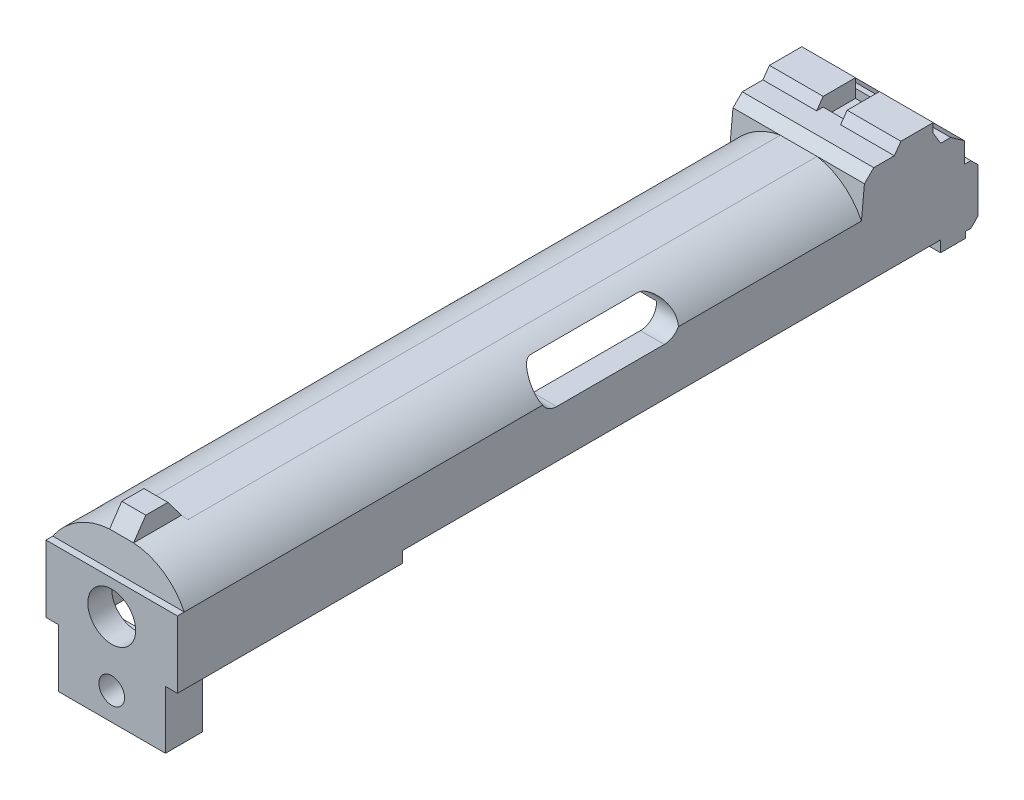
ISO-10303-21;
HEADER;
FILE_DESCRIPTION(('STEP AP214'),'2;1');
FILE_NAME('part.step','',(''),(''),'','','');
FILE_SCHEMA(('AUTOMOTIVE_DESIGN { 1 0 10303 214 1 1 1 1 }'));
ENDSEC;
DATA;
#1=APPLICATION_CONTEXT('core data for automotive mechanical design processes');
#2=APPLICATION_PROTOCOL_DEFINITION('international standard','automotive_design',2000,#1);
#3=PRODUCT_CONTEXT('',#1,'mechanical');
#4=PRODUCT('Part','Part','',(#3));
#5=PRODUCT_RELATED_PRODUCT_CATEGORY('part','',(#4));
#6=PRODUCT_DEFINITION_FORMATION('','',#4);
#7=PRODUCT_DEFINITION_CONTEXT('part definition',#1,'design');
#8=PRODUCT_DEFINITION('design','',#6,#7);
#9=PRODUCT_DEFINITION_SHAPE('','',#8);
#10=(LENGTH_UNIT() NAMED_UNIT(*) SI_UNIT(.MILLI.,.METRE.));
#11=(NAMED_UNIT(*) PLANE_ANGLE_UNIT() SI_UNIT($,.RADIAN.));
#12=(NAMED_UNIT(*) SI_UNIT($,.STERADIAN.) SOLID_ANGLE_UNIT());
#13=UNCERTAINTY_MEASURE_WITH_UNIT(LENGTH_MEASURE(1.E-05),#10,'distance_accuracy_value','');
#14=(GEOMETRIC_REPRESENTATION_CONTEXT(3) GLOBAL_UNCERTAINTY_ASSIGNED_CONTEXT((#13)) GLOBAL_UNIT_ASSIGNED_CONTEXT((#10,
#11,#12)) REPRESENTATION_CONTEXT('',''));
#15=CARTESIAN_POINT('',(0.,0.,0.));
#16=DIRECTION('',(0.,0.,1.));
#17=DIRECTION('',(1.,0.,0.));
#18=AXIS2_PLACEMENT_3D('',#15,#16,#17);
#19=CARTESIAN_POINT('',(27.94,92.8377324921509,81.3961833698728));
#20=DIRECTION('',(0.,1.,0.));
#21=DIRECTION('',(0.,0.,1.));
#22=AXIS2_PLACEMENT_3D('',#19,#20,#21);
#23=PLANE('',#22);
#24=DIRECTION('',(0.,0.,-1.));
#25=VECTOR('',#24,1.);
#26=CARTESIAN_POINT('',(27.94,92.8377324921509,80.7462594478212));
#27=LINE('',#26,#25);
#28=CARTESIAN_POINT('',(27.94,92.8377324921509,86.0779010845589));
#29=VERTEX_POINT('',#28);
#30=CARTESIAN_POINT('',(27.94,92.8377324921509,80.7462594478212));
#31=VERTEX_POINT('',#30);
#32=EDGE_CURVE('E422',#29,#31,#27,.T.);
#33=ORIENTED_EDGE('',*,*,#32,.F.);
#34=DIRECTION('',(-1.,0.,0.));
#35=VECTOR('',#34,1.);
#36=CARTESIAN_POINT('',(64.77,92.8377324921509,86.0779010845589));
#37=LINE('',#36,#35);
#38=CARTESIAN_POINT('',(22.86,92.8377324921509,86.0779010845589));
#39=VERTEX_POINT('',#38);
#40=EDGE_CURVE('E411',#29,#39,#37,.T.);
#41=ORIENTED_EDGE('',*,*,#40,.T.);
#42=DIRECTION('',(0.,0.,1.));
#43=VECTOR('',#42,1.);
#44=CARTESIAN_POINT('',(22.86,92.8377324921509,85.8262594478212));
#45=LINE('',#44,#43);
#46=CARTESIAN_POINT('',(22.86,92.8377324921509,85.8262594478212));
#47=VERTEX_POINT('',#46);
#48=EDGE_CURVE('E522',#47,#39,#45,.T.);
#49=ORIENTED_EDGE('',*,*,#48,.F.);
#50=DIRECTION('',(1.,0.,0.));
#51=VECTOR('',#50,1.);
#52=CARTESIAN_POINT('',(5.08,92.8377324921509,85.8262594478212));
#53=LINE('',#52,#51);
#54=CARTESIAN_POINT('',(5.08,92.8377324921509,85.8262594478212));
#55=VERTEX_POINT('',#54);
#56=EDGE_CURVE('E527',#55,#47,#53,.T.);
#57=ORIENTED_EDGE('',*,*,#56,.F.);
#58=DIRECTION('',(0.,0.,-1.));
#59=VECTOR('',#58,1.);
#60=CARTESIAN_POINT('',(5.08,92.8377324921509,243.181436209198));
#61=LINE('',#60,#59);
#62=CARTESIAN_POINT('',(5.08,92.8377324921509,86.0779010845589));
#63=VERTEX_POINT('',#62);
#64=EDGE_CURVE('E410',#63,#55,#61,.T.);
#65=ORIENTED_EDGE('',*,*,#64,.F.);
#66=CARTESIAN_POINT('',(0.,92.8377324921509,86.0779010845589));
#67=VERTEX_POINT('',#66);
#68=EDGE_CURVE('E394',#63,#67,#37,.T.);
#69=ORIENTED_EDGE('',*,*,#68,.T.);
#70=DIRECTION('',(0.,0.,-1.));
#71=VECTOR('',#70,1.);
#72=CARTESIAN_POINT('',(0.,92.8377324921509,81.3961833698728));
#73=LINE('',#72,#71);
#74=CARTESIAN_POINT('',(0.,92.8377324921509,80.7462594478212));
#75=VERTEX_POINT('',#74);
#76=EDGE_CURVE('E407',#67,#75,#73,.T.);
#77=ORIENTED_EDGE('',*,*,#76,.T.);
#78=DIRECTION('',(-1.,0.,0.));
#79=VECTOR('',#78,1.);
#80=CARTESIAN_POINT('',(27.94,92.8377324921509,80.7462594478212));
#81=LINE('',#80,#79);
#82=EDGE_CURVE('E920',#31,#75,#81,.T.);
#83=ORIENTED_EDGE('',*,*,#82,.F.);
#84=EDGE_LOOP('',(#33,#41,#49,#57,#65,#69,#77,#83));
#85=FACE_BOUND('',#84,.T.);
#86=ADVANCED_FACE('F33',(#85),#23,.F.);
#87=CARTESIAN_POINT('',(0.,92.8377324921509,248.261436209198));
#88=VERTEX_POINT('',#87);
#89=CARTESIAN_POINT('',(0.,92.8377324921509,200.377901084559));
#90=VERTEX_POINT('',#89);
#91=EDGE_CURVE('E418',#88,#90,#73,.T.);
#92=ORIENTED_EDGE('',*,*,#91,.T.);
#93=DIRECTION('',(-1.,0.,0.));
#94=VECTOR('',#93,1.);
#95=CARTESIAN_POINT('',(64.77,92.8377324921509,200.377901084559));
#96=LINE('',#95,#94);
#97=CARTESIAN_POINT('',(5.08,92.8377324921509,200.377901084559));
#98=VERTEX_POINT('',#97);
#99=EDGE_CURVE('E632',#98,#90,#96,.T.);
#100=ORIENTED_EDGE('',*,*,#99,.F.);
#101=CARTESIAN_POINT('',(5.08,92.8377324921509,240.387436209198));
#102=VERTEX_POINT('',#101);
#103=EDGE_CURVE('E749',#102,#98,#61,.T.);
#104=ORIENTED_EDGE('',*,*,#103,.F.);
#105=DIRECTION('',(-1.,0.,0.));
#106=VECTOR('',#105,1.);
#107=CARTESIAN_POINT('',(2.64788815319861,92.8377324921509,240.387436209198));
#108=LINE('',#107,#106);
#109=CARTESIAN_POINT('',(2.64788815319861,92.8377324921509,240.387436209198));
#110=VERTEX_POINT('',#109);
#111=EDGE_CURVE('E443',#102,#110,#108,.T.);
#112=ORIENTED_EDGE('',*,*,#111,.T.);
#113=DIRECTION('',(0.,0.,-1.));
#114=VECTOR('',#113,1.);
#115=CARTESIAN_POINT('',(2.64788815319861,92.8377324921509,248.261436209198));
#116=LINE('',#115,#114);
#117=CARTESIAN_POINT('',(2.64788815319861,92.8377324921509,248.261436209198));
#118=VERTEX_POINT('',#117);
#119=EDGE_CURVE('E636',#118,#110,#116,.T.);
#120=ORIENTED_EDGE('',*,*,#119,.F.);
#121=DIRECTION('',(-1.,0.,0.));
#122=VECTOR('',#121,1.);
#123=CARTESIAN_POINT('',(27.94,92.8377324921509,248.261436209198));
#124=LINE('',#123,#122);
#125=EDGE_CURVE('E434',#118,#88,#124,.T.);
#126=ORIENTED_EDGE('',*,*,#125,.T.);
#127=EDGE_LOOP('',(#92,#100,#104,#112,#120,#126));
#128=FACE_BOUND('',#127,.T.);
#129=ADVANCED_FACE('F491',(#128),#23,.F.);
#130=CARTESIAN_POINT('',(-18.5531789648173,86.678232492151,240.387436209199));
#131=DIRECTION('',(0.,0.,-1.));
#132=DIRECTION('',(0.,1.,0.));
#133=AXIS2_PLACEMENT_3D('',#130,#131,#132);
#134=PLANE('',#133);
#135=CARTESIAN_POINT('',(13.97,86.3717601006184,240.387436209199));
#136=DIRECTION('',(0.,0.,-1.));
#137=DIRECTION('',(0.,1.,0.));
#138=AXIS2_PLACEMENT_3D('',#135,#136,#137);
#139=CIRCLE('',#138,2.7305);
#140=CARTESIAN_POINT('',(13.97,89.1022601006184,240.387436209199));
#141=VERTEX_POINT('',#140);
#142=EDGE_CURVE('E707',#141,#141,#139,.F.);
#143=ORIENTED_EDGE('',*,*,#142,.T.);
#144=EDGE_LOOP('',(#143));
#145=FACE_BOUND('',#144,.T.);
#146=DIRECTION('',(1.,0.,0.));
#147=VECTOR('',#146,1.);
#148=CARTESIAN_POINT('',(13.97,80.518732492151,240.387436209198));
#149=LINE('',#148,#147);
#150=CARTESIAN_POINT('',(2.64788815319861,80.518732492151,240.387436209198));
#151=VERTEX_POINT('',#150);
#152=CARTESIAN_POINT('',(25.3879659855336,80.518732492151,240.387436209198));
#153=VERTEX_POINT('',#152);
#154=EDGE_CURVE('E661',#151,#153,#149,.T.);
#155=ORIENTED_EDGE('',*,*,#154,.F.);
#156=DIRECTION('',(0.,-1.,0.));
#157=VECTOR('',#156,1.);
#158=CARTESIAN_POINT('',(2.64788815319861,80.518732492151,240.387436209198));
#159=LINE('',#158,#157);
#160=EDGE_CURVE('E648',#110,#151,#159,.T.);
#161=ORIENTED_EDGE('',*,*,#160,.F.);
#162=ORIENTED_EDGE('',*,*,#111,.F.);
#163=CARTESIAN_POINT('',(22.86,92.8377324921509,240.387436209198));
#164=VERTEX_POINT('',#163);
#165=EDGE_CURVE('E644',#164,#102,#108,.T.);
#166=ORIENTED_EDGE('',*,*,#165,.F.);
#167=CARTESIAN_POINT('',(25.3879659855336,92.8377324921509,240.387436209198));
#168=VERTEX_POINT('',#167);
#169=EDGE_CURVE('E518',#168,#164,#108,.T.);
#170=ORIENTED_EDGE('',*,*,#169,.F.);
#171=DIRECTION('',(0.,1.,0.));
#172=VECTOR('',#171,1.);
#173=CARTESIAN_POINT('',(25.3879659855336,80.518732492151,240.387436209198));
#174=LINE('',#173,#172);
#175=EDGE_CURVE('E717',#153,#168,#174,.T.);
#176=ORIENTED_EDGE('',*,*,#175,.F.);
#177=EDGE_LOOP('',(#155,#161,#162,#166,#170,#176));
#178=FACE_BOUND('',#177,.T.);
#179=ADVANCED_FACE('F497',(#145,#178),#134,.T.);
#180=CARTESIAN_POINT('',(27.94,115.604000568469,95.8873820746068));
#181=DIRECTION('',(0.,-0.576475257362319,-0.817114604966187));
#182=DIRECTION('',(0.,0.817114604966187,-0.576475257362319));
#183=AXIS2_PLACEMENT_3D('',#180,#181,#182);
#184=PLANE('',#183);
#185=DIRECTION('',(-1.,0.,0.));
#186=VECTOR('',#185,1.);
#187=CARTESIAN_POINT('',(27.94,117.578884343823,94.4940993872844));
#188=LINE('',#187,#186);
#189=CARTESIAN_POINT('',(27.94,117.578884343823,94.4940993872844));
#190=VERTEX_POINT('',#189);
#191=CARTESIAN_POINT('',(16.5191460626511,117.578884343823,94.4940993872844));
#192=VERTEX_POINT('',#191);
#193=EDGE_CURVE('E882',#190,#192,#188,.T.);
#194=ORIENTED_EDGE('',*,*,#193,.T.);
#195=DIRECTION('',(0.,0.817114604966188,-0.576475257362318));
#196=VECTOR('',#195,1.);
#197=CARTESIAN_POINT('',(16.5191460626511,115.604000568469,95.8873820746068));
#198=LINE('',#197,#196);
#199=CARTESIAN_POINT('',(16.5191460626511,115.604000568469,95.8873820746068));
#200=VERTEX_POINT('',#199);
#201=EDGE_CURVE('E1626',#200,#192,#198,.T.);
#202=ORIENTED_EDGE('',*,*,#201,.F.);
#203=DIRECTION('',(-1.,0.,0.));
#204=VECTOR('',#203,1.);
#205=CARTESIAN_POINT('',(27.94,115.604000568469,95.8873820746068));
#206=LINE('',#205,#204);
#207=CARTESIAN_POINT('',(27.94,115.604000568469,95.8873820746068));
#208=VERTEX_POINT('',#207);
#209=EDGE_CURVE('E878',#208,#200,#206,.T.);
#210=ORIENTED_EDGE('',*,*,#209,.F.);
#211=DIRECTION('',(0.,-0.817114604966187,0.576475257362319));
#212=VECTOR('',#211,1.);
#213=CARTESIAN_POINT('',(27.94,115.604000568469,95.8873820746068));
#214=LINE('',#213,#212);
#215=EDGE_CURVE('E569',#190,#208,#214,.T.);
#216=ORIENTED_EDGE('',*,*,#215,.F.);
#217=EDGE_LOOP('',(#194,#202,#210,#216));
#218=FACE_BOUND('',#217,.T.);
#219=ADVANCED_FACE('F954',(#218),#184,.F.);
#220=CARTESIAN_POINT('',(27.94,117.578884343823,87.6205714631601));
#221=DIRECTION('',(0.,0.,1.));
#222=DIRECTION('',(1.,0.,0.));
#223=AXIS2_PLACEMENT_3D('',#220,#221,#222);
#224=PLANE('',#223);
#225=DIRECTION('',(-1.,0.,0.));
#226=VECTOR('',#225,1.);
#227=CARTESIAN_POINT('',(27.94,115.604000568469,87.6205714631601));
#228=LINE('',#227,#226);
#229=CARTESIAN_POINT('',(27.94,115.604000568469,87.6205714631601));
#230=VERTEX_POINT('',#229);
#231=CARTESIAN_POINT('',(16.5191460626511,115.604000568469,87.6205714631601));
#232=VERTEX_POINT('',#231);
#233=EDGE_CURVE('E890',#230,#232,#228,.T.);
#234=ORIENTED_EDGE('',*,*,#233,.T.);
#235=DIRECTION('',(0.,1.,0.));
#236=VECTOR('',#235,1.);
#237=CARTESIAN_POINT('',(16.5191460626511,113.768884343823,87.6205714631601));
#238=LINE('',#237,#236);
#239=CARTESIAN_POINT('',(16.5191460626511,117.578884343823,87.6205714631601));
#240=VERTEX_POINT('',#239);
#241=EDGE_CURVE('E787',#232,#240,#238,.T.);
#242=ORIENTED_EDGE('',*,*,#241,.T.);
#243=DIRECTION('',(-1.,0.,0.));
#244=VECTOR('',#243,1.);
#245=CARTESIAN_POINT('',(27.94,117.578884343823,87.6205714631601));
#246=LINE('',#245,#244);
#247=CARTESIAN_POINT('',(27.94,117.578884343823,87.6205714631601));
#248=VERTEX_POINT('',#247);
#249=EDGE_CURVE('E886',#248,#240,#246,.T.);
#250=ORIENTED_EDGE('',*,*,#249,.F.);
#251=DIRECTION('',(0.,1.,0.));
#252=VECTOR('',#251,1.);
#253=CARTESIAN_POINT('',(27.94,117.578884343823,87.6205714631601));
#254=LINE('',#253,#252);
#255=EDGE_CURVE('E565',#230,#248,#254,.T.);
#256=ORIENTED_EDGE('',*,*,#255,.F.);
#257=EDGE_LOOP('',(#234,#242,#250,#256));
#258=FACE_BOUND('',#257,.T.);
#259=ADVANCED_FACE('F1157',(#258),#224,.F.);
#260=CARTESIAN_POINT('',(27.94,117.578884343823,94.4940993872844));
#261=DIRECTION('',(0.,-1.,0.));
#262=DIRECTION('',(0.,0.,-1.));
#263=AXIS2_PLACEMENT_3D('',#260,#261,#262);
#264=PLANE('',#263);
#265=ORIENTED_EDGE('',*,*,#249,.T.);
#266=DIRECTION('',(0.,0.,-1.));
#267=VECTOR('',#266,1.);
#268=CARTESIAN_POINT('',(16.5191460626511,117.578884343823,87.6205714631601));
#269=LINE('',#268,#267);
#270=EDGE_CURVE('E790',#192,#240,#269,.T.);
#271=ORIENTED_EDGE('',*,*,#270,.F.);
#272=ORIENTED_EDGE('',*,*,#193,.F.);
#273=DIRECTION('',(0.,0.,1.));
#274=VECTOR('',#273,1.);
#275=CARTESIAN_POINT('',(27.94,117.578884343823,94.4940993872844));
#276=LINE('',#275,#274);
#277=EDGE_CURVE('E567',#248,#190,#276,.T.);
#278=ORIENTED_EDGE('',*,*,#277,.F.);
#279=EDGE_LOOP('',(#265,#271,#272,#278));
#280=FACE_BOUND('',#279,.T.);
#281=ADVANCED_FACE('F1253',(#280),#264,.F.);
#282=CARTESIAN_POINT('',(27.94,94.1057712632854,80.7462594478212));
#283=DIRECTION('',(0.,0.,1.));
#284=DIRECTION('',(1.,0.,0.));
#285=AXIS2_PLACEMENT_3D('',#282,#283,#284);
#286=PLANE('',#285);
#287=DIRECTION('',(0.,1.,0.));
#288=VECTOR('',#287,1.);
#289=CARTESIAN_POINT('',(0.,94.1057712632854,80.7462594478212));
#290=LINE('',#289,#288);
#291=CARTESIAN_POINT('',(0.,94.1057712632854,80.7462594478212));
#292=VERTEX_POINT('',#291);
#293=EDGE_CURVE('E416',#75,#292,#290,.T.);
#294=ORIENTED_EDGE('',*,*,#293,.T.);
#295=DIRECTION('',(-1.,0.,0.));
#296=VECTOR('',#295,1.);
#297=CARTESIAN_POINT('',(27.94,94.1057712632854,80.7462594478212));
#298=LINE('',#297,#296);
#299=CARTESIAN_POINT('',(27.94,94.1057712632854,80.7462594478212));
#300=VERTEX_POINT('',#299);
#301=EDGE_CURVE('E917',#300,#292,#298,.T.);
#302=ORIENTED_EDGE('',*,*,#301,.F.);
#303=DIRECTION('',(0.,1.,0.));
#304=VECTOR('',#303,1.);
#305=CARTESIAN_POINT('',(27.94,94.1057712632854,80.7462594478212));
#306=LINE('',#305,#304);
#307=EDGE_CURVE('E545',#31,#300,#306,.T.);
#308=ORIENTED_EDGE('',*,*,#307,.F.);
#309=ORIENTED_EDGE('',*,*,#82,.T.);
#310=EDGE_LOOP('',(#294,#302,#308,#309));
#311=FACE_BOUND('',#310,.T.);
#312=ADVANCED_FACE('F35',(#311),#286,.F.);
#313=CARTESIAN_POINT('',(27.94,94.1057712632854,79.6144907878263));
#314=DIRECTION('',(0.,1.,0.));
#315=DIRECTION('',(0.,0.,1.));
#316=AXIS2_PLACEMENT_3D('',#313,#314,#315);
#317=PLANE('',#316);
#318=DIRECTION('',(0.,0.,-1.));
#319=VECTOR('',#318,1.);
#320=CARTESIAN_POINT('',(0.,94.1057712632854,79.6144907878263));
#321=LINE('',#320,#319);
#322=CARTESIAN_POINT('',(0.,94.1057712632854,79.6144907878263));
#323=VERTEX_POINT('',#322);
#324=EDGE_CURVE('E582',#292,#323,#321,.T.);
#325=ORIENTED_EDGE('',*,*,#324,.T.);
#326=DIRECTION('',(-1.,0.,0.));
#327=VECTOR('',#326,1.);
#328=CARTESIAN_POINT('',(27.94,94.1057712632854,79.6144907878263));
#329=LINE('',#328,#327);
#330=CARTESIAN_POINT('',(27.94,94.1057712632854,79.6144907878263));
#331=VERTEX_POINT('',#330);
#332=EDGE_CURVE('E914',#331,#323,#329,.T.);
#333=ORIENTED_EDGE('',*,*,#332,.F.);
#334=DIRECTION('',(0.,0.,-1.));
#335=VECTOR('',#334,1.);
#336=CARTESIAN_POINT('',(27.94,94.1057712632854,79.6144907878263));
#337=LINE('',#336,#335);
#338=EDGE_CURVE('E547',#300,#331,#337,.T.);
#339=ORIENTED_EDGE('',*,*,#338,.F.);
#340=ORIENTED_EDGE('',*,*,#301,.T.);
#341=EDGE_LOOP('',(#325,#333,#339,#340));
#342=FACE_BOUND('',#341,.T.);
#343=ADVANCED_FACE('F1325',(#342),#317,.F.);
#344=CARTESIAN_POINT('',(27.94,95.6163664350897,78.103895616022));
#345=DIRECTION('',(0.,0.707106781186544,0.707106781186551));
#346=DIRECTION('',(0.,-0.707106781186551,0.707106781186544));
#347=AXIS2_PLACEMENT_3D('',#344,#345,#346);
#348=PLANE('',#347);
#349=DIRECTION('',(0.,0.707106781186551,-0.707106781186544));
#350=VECTOR('',#349,1.);
#351=CARTESIAN_POINT('',(0.,95.6163664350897,78.103895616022));
#352=LINE('',#351,#350);
#353=CARTESIAN_POINT('',(0.,95.6163664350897,78.103895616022));
#354=VERTEX_POINT('',#353);
#355=EDGE_CURVE('E584',#323,#354,#352,.T.);
#356=ORIENTED_EDGE('',*,*,#355,.T.);
#357=DIRECTION('',(-1.,0.,0.));
#358=VECTOR('',#357,1.);
#359=CARTESIAN_POINT('',(27.94,95.6163664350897,78.103895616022));
#360=LINE('',#359,#358);
#361=CARTESIAN_POINT('',(27.94,95.6163664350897,78.103895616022));
#362=VERTEX_POINT('',#361);
#363=EDGE_CURVE('E911',#362,#354,#360,.T.);
#364=ORIENTED_EDGE('',*,*,#363,.F.);
#365=DIRECTION('',(0.,0.707106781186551,-0.707106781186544));
#366=VECTOR('',#365,1.);
#367=CARTESIAN_POINT('',(27.94,95.6163664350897,78.103895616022));
#368=LINE('',#367,#366);
#369=EDGE_CURVE('E549',#331,#362,#368,.T.);
#370=ORIENTED_EDGE('',*,*,#369,.F.);
#371=ORIENTED_EDGE('',*,*,#332,.T.);
#372=EDGE_LOOP('',(#356,#364,#370,#371));
#373=FACE_BOUND('',#372,.T.);
#374=ADVANCED_FACE('F1317',(#373),#348,.F.);
#375=CARTESIAN_POINT('',(27.94,105.060050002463,78.103895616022));
#376=DIRECTION('',(0.,0.,1.));
#377=DIRECTION('',(1.,0.,0.));
#378=AXIS2_PLACEMENT_3D('',#375,#376,#377);
#379=PLANE('',#378);
#380=DIRECTION('',(0.,1.,0.));
#381=VECTOR('',#380,1.);
#382=CARTESIAN_POINT('',(0.,105.060050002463,78.103895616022));
#383=LINE('',#382,#381);
#384=CARTESIAN_POINT('',(0.,105.060050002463,78.103895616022));
#385=VERTEX_POINT('',#384);
#386=EDGE_CURVE('E586',#354,#385,#383,.T.);
#387=ORIENTED_EDGE('',*,*,#386,.T.);
#388=DIRECTION('',(-1.,0.,0.));
#389=VECTOR('',#388,1.);
#390=CARTESIAN_POINT('',(27.94,105.060050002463,78.103895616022));
#391=LINE('',#390,#389);
#392=CARTESIAN_POINT('',(27.94,105.060050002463,78.103895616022));
#393=VERTEX_POINT('',#392);
#394=EDGE_CURVE('E908',#393,#385,#391,.T.);
#395=ORIENTED_EDGE('',*,*,#394,.F.);
#396=DIRECTION('',(0.,1.,0.));
#397=VECTOR('',#396,1.);
#398=CARTESIAN_POINT('',(27.94,105.060050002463,78.103895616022));
#399=LINE('',#398,#397);
#400=EDGE_CURVE('E551',#362,#393,#399,.T.);
#401=ORIENTED_EDGE('',*,*,#400,.F.);
#402=ORIENTED_EDGE('',*,*,#363,.T.);
#403=EDGE_LOOP('',(#387,#395,#401,#402));
#404=FACE_BOUND('',#403,.T.);
#405=ADVANCED_FACE('F1309',(#404),#379,.F.);
#406=CARTESIAN_POINT('',(27.94,106.570645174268,79.6144907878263));
#407=DIRECTION('',(0.,-0.707106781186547,0.707106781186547));
#408=DIRECTION('',(0.,-0.707106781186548,-0.707106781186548));
#409=AXIS2_PLACEMENT_3D('',#406,#407,#408);
#410=PLANE('',#409);
#411=DIRECTION('',(0.,0.707106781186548,0.707106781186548));
#412=VECTOR('',#411,1.);
#413=CARTESIAN_POINT('',(0.,106.570645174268,79.6144907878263));
#414=LINE('',#413,#412);
#415=CARTESIAN_POINT('',(0.,106.570645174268,79.6144907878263));
#416=VERTEX_POINT('',#415);
#417=EDGE_CURVE('E588',#385,#416,#414,.T.);
#418=ORIENTED_EDGE('',*,*,#417,.T.);
#419=DIRECTION('',(-1.,0.,0.));
#420=VECTOR('',#419,1.);
#421=CARTESIAN_POINT('',(27.94,106.570645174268,79.6144907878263));
#422=LINE('',#421,#420);
#423=CARTESIAN_POINT('',(27.94,106.570645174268,79.6144907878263));
#424=VERTEX_POINT('',#423);
#425=EDGE_CURVE('E905',#424,#416,#422,.T.);
#426=ORIENTED_EDGE('',*,*,#425,.F.);
#427=DIRECTION('',(0.,0.707106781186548,0.707106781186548));
#428=VECTOR('',#427,1.);
#429=CARTESIAN_POINT('',(27.94,106.570645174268,79.6144907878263));
#430=LINE('',#429,#428);
#431=EDGE_CURVE('E553',#393,#424,#430,.T.);
#432=ORIENTED_EDGE('',*,*,#431,.F.);
#433=ORIENTED_EDGE('',*,*,#394,.T.);
#434=EDGE_LOOP('',(#418,#426,#432,#433));
#435=FACE_BOUND('',#434,.T.);
#436=ADVANCED_FACE('F1301',(#435),#410,.F.);
#437=CARTESIAN_POINT('',(27.94,106.570645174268,80.9869397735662));
#438=DIRECTION('',(0.,-1.,0.));
#439=DIRECTION('',(0.,0.,-1.));
#440=AXIS2_PLACEMENT_3D('',#437,#438,#439);
#441=PLANE('',#440);
#442=DIRECTION('',(0.,0.,1.));
#443=VECTOR('',#442,1.);
#444=CARTESIAN_POINT('',(0.,106.570645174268,80.9869397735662));
#445=LINE('',#444,#443);
#446=CARTESIAN_POINT('',(0.,106.570645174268,80.9869397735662));
#447=VERTEX_POINT('',#446);
#448=EDGE_CURVE('E590',#416,#447,#445,.T.);
#449=ORIENTED_EDGE('',*,*,#448,.T.);
#450=DIRECTION('',(-1.,0.,0.));
#451=VECTOR('',#450,1.);
#452=CARTESIAN_POINT('',(27.94,106.570645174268,80.9869397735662));
#453=LINE('',#452,#451);
#454=CARTESIAN_POINT('',(27.94,106.570645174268,80.9869397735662));
#455=VERTEX_POINT('',#454);
#456=EDGE_CURVE('E902',#455,#447,#453,.T.);
#457=ORIENTED_EDGE('',*,*,#456,.F.);
#458=DIRECTION('',(0.,0.,1.));
#459=VECTOR('',#458,1.);
#460=CARTESIAN_POINT('',(27.94,106.570645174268,80.9869397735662));
#461=LINE('',#460,#459);
#462=EDGE_CURVE('E555',#424,#455,#461,.T.);
#463=ORIENTED_EDGE('',*,*,#462,.F.);
#464=ORIENTED_EDGE('',*,*,#425,.T.);
#465=EDGE_LOOP('',(#449,#457,#463,#464));
#466=FACE_BOUND('',#465,.T.);
#467=ADVANCED_FACE('F1293',(#466),#441,.F.);
#468=CARTESIAN_POINT('',(27.94,110.921407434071,80.9869397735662));
#469=DIRECTION('',(0.,0.,1.));
#470=DIRECTION('',(0.,-1.,0.));
#471=AXIS2_PLACEMENT_3D('',#468,#469,#470);
#472=PLANE('',#471);
#473=DIRECTION('',(0.,1.,0.));
#474=VECTOR('',#473,1.);
#475=CARTESIAN_POINT('',(0.,110.921407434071,80.9869397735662));
#476=LINE('',#475,#474);
#477=CARTESIAN_POINT('',(0.,110.921407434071,80.9869397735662));
#478=VERTEX_POINT('',#477);
#479=EDGE_CURVE('E592',#447,#478,#476,.T.);
#480=ORIENTED_EDGE('',*,*,#479,.T.);
#481=DIRECTION('',(-1.,0.,0.));
#482=VECTOR('',#481,1.);
#483=CARTESIAN_POINT('',(27.94,110.921407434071,80.9869397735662));
#484=LINE('',#483,#482);
#485=CARTESIAN_POINT('',(27.94,110.921407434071,80.9869397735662));
#486=VERTEX_POINT('',#485);
#487=EDGE_CURVE('E899',#486,#478,#484,.T.);
#488=ORIENTED_EDGE('',*,*,#487,.F.);
#489=DIRECTION('',(0.,1.,0.));
#490=VECTOR('',#489,1.);
#491=CARTESIAN_POINT('',(27.94,110.921407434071,80.9869397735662));
#492=LINE('',#491,#490);
#493=EDGE_CURVE('E557',#455,#486,#492,.T.);
#494=ORIENTED_EDGE('',*,*,#493,.F.);
#495=ORIENTED_EDGE('',*,*,#456,.T.);
#496=EDGE_LOOP('',(#480,#488,#494,#495));
#497=FACE_BOUND('',#496,.T.);
#498=ADVANCED_FACE('F1285',(#497),#472,.F.);
#499=CARTESIAN_POINT('',(27.94,112.980208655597,83.9051509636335));
#500=DIRECTION('',(0.,-0.817114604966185,0.576475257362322));
#501=DIRECTION('',(0.,-0.576475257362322,-0.817114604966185));
#502=AXIS2_PLACEMENT_3D('',#499,#500,#501);
#503=PLANE('',#502);
#504=DIRECTION('',(0.,0.576475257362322,0.817114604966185));
#505=VECTOR('',#504,1.);
#506=CARTESIAN_POINT('',(0.,112.980208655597,83.9051509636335));
#507=LINE('',#506,#505);
#508=CARTESIAN_POINT('',(0.,112.980208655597,83.9051509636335));
#509=VERTEX_POINT('',#508);
#510=EDGE_CURVE('E594',#478,#509,#507,.T.);
#511=ORIENTED_EDGE('',*,*,#510,.T.);
#512=DIRECTION('',(-1.,0.,0.));
#513=VECTOR('',#512,1.);
#514=CARTESIAN_POINT('',(27.94,112.980208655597,83.9051509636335));
#515=LINE('',#514,#513);
#516=CARTESIAN_POINT('',(27.94,112.980208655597,83.9051509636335));
#517=VERTEX_POINT('',#516);
#518=EDGE_CURVE('E896',#517,#509,#515,.T.);
#519=ORIENTED_EDGE('',*,*,#518,.F.);
#520=DIRECTION('',(0.,0.576475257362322,0.817114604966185));
#521=VECTOR('',#520,1.);
#522=CARTESIAN_POINT('',(27.94,112.980208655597,83.9051509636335));
#523=LINE('',#522,#521);
#524=EDGE_CURVE('E559',#486,#517,#523,.T.);
#525=ORIENTED_EDGE('',*,*,#524,.F.);
#526=ORIENTED_EDGE('',*,*,#487,.T.);
#527=EDGE_LOOP('',(#511,#519,#525,#526));
#528=FACE_BOUND('',#527,.T.);
#529=ADVANCED_FACE('F1276',(#528),#503,.F.);
#530=CARTESIAN_POINT('',(27.94,112.980208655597,86.0415177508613));
#531=DIRECTION('',(0.,-1.,0.));
#532=DIRECTION('',(0.,0.,-1.));
#533=AXIS2_PLACEMENT_3D('',#530,#531,#532);
#534=PLANE('',#533);
#535=DIRECTION('',(0.,0.,1.));
#536=VECTOR('',#535,1.);
#537=CARTESIAN_POINT('',(0.,112.980208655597,86.0415177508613));
#538=LINE('',#537,#536);
#539=CARTESIAN_POINT('',(0.,112.980208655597,86.0415177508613));
#540=VERTEX_POINT('',#539);
#541=EDGE_CURVE('E596',#509,#540,#538,.T.);
#542=ORIENTED_EDGE('',*,*,#541,.T.);
#543=DIRECTION('',(-1.,0.,0.));
#544=VECTOR('',#543,1.);
#545=CARTESIAN_POINT('',(27.94,112.980208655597,86.0415177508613));
#546=LINE('',#545,#544);
#547=CARTESIAN_POINT('',(27.94,112.980208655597,86.0415177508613));
#548=VERTEX_POINT('',#547);
#549=EDGE_CURVE('E893',#548,#540,#546,.T.);
#550=ORIENTED_EDGE('',*,*,#549,.F.);
#551=DIRECTION('',(0.,0.,1.));
#552=VECTOR('',#551,1.);
#553=CARTESIAN_POINT('',(27.94,112.980208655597,86.0415177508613));
#554=LINE('',#553,#552);
#555=EDGE_CURVE('E561',#517,#548,#554,.T.);
#556=ORIENTED_EDGE('',*,*,#555,.F.);
#557=ORIENTED_EDGE('',*,*,#518,.T.);
#558=EDGE_LOOP('',(#542,#550,#556,#557));
#559=FACE_BOUND('',#558,.T.);
#560=ADVANCED_FACE('F1267',(#559),#534,.F.);
#561=CARTESIAN_POINT('',(27.94,115.604000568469,87.6205714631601));
#562=DIRECTION('',(0.,-0.515642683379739,0.856803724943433));
#563=DIRECTION('',(0.,-0.856803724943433,-0.515642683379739));
#564=AXIS2_PLACEMENT_3D('',#561,#562,#563);
#565=PLANE('',#564);
#566=DIRECTION('',(0.,0.856803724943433,0.515642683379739));
#567=VECTOR('',#566,1.);
#568=CARTESIAN_POINT('',(0.,115.604000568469,87.6205714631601));
#569=LINE('',#568,#567);
#570=CARTESIAN_POINT('',(0.,115.604000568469,87.6205714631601));
#571=VERTEX_POINT('',#570);
#572=EDGE_CURVE('E598',#540,#571,#569,.T.);
#573=ORIENTED_EDGE('',*,*,#572,.T.);
#574=CARTESIAN_POINT('',(11.4208539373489,115.604000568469,87.6205714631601));
#575=VERTEX_POINT('',#574);
#576=EDGE_CURVE('E889',#575,#571,#228,.T.);
#577=ORIENTED_EDGE('',*,*,#576,.F.);
#578=DIRECTION('',(1.,0.,0.));
#579=VECTOR('',#578,1.);
#580=CARTESIAN_POINT('',(27.94,115.604000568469,87.6205714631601));
#581=LINE('',#580,#579);
#582=EDGE_CURVE('E773',#575,#232,#581,.T.);
#583=ORIENTED_EDGE('',*,*,#582,.T.);
#584=ORIENTED_EDGE('',*,*,#233,.F.);
#585=DIRECTION('',(0.,0.856803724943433,0.515642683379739));
#586=VECTOR('',#585,1.);
#587=CARTESIAN_POINT('',(27.94,115.604000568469,87.6205714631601));
#588=LINE('',#587,#586);
#589=EDGE_CURVE('E563',#548,#230,#588,.T.);
#590=ORIENTED_EDGE('',*,*,#589,.F.);
#591=ORIENTED_EDGE('',*,*,#549,.T.);
#592=EDGE_LOOP('',(#573,#577,#583,#584,#590,#591));
#593=FACE_BOUND('',#592,.T.);
#594=ADVANCED_FACE('F1258',(#593),#565,.F.);
#595=CARTESIAN_POINT('',(11.4208539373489,117.578884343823,87.6205714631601));
#596=VERTEX_POINT('',#595);
#597=CARTESIAN_POINT('',(0.,117.578884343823,87.6205714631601));
#598=VERTEX_POINT('',#597);
#599=EDGE_CURVE('E885',#596,#598,#246,.T.);
#600=ORIENTED_EDGE('',*,*,#599,.F.);
#601=DIRECTION('',(0.,1.,0.));
#602=VECTOR('',#601,1.);
#603=CARTESIAN_POINT('',(11.4208539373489,113.768884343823,87.6205714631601));
#604=LINE('',#603,#602);
#605=EDGE_CURVE('E781',#575,#596,#604,.T.);
#606=ORIENTED_EDGE('',*,*,#605,.F.);
#607=ORIENTED_EDGE('',*,*,#576,.T.);
#608=DIRECTION('',(0.,1.,0.));
#609=VECTOR('',#608,1.);
#610=CARTESIAN_POINT('',(0.,117.578884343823,87.6205714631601));
#611=LINE('',#610,#609);
#612=EDGE_CURVE('E601',#571,#598,#611,.T.);
#613=ORIENTED_EDGE('',*,*,#612,.T.);
#614=EDGE_LOOP('',(#600,#606,#607,#613));
#615=FACE_BOUND('',#614,.T.);
#616=ADVANCED_FACE('F1250',(#615),#224,.F.);
#617=CARTESIAN_POINT('',(11.4208539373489,117.578884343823,94.4940993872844));
#618=VERTEX_POINT('',#617);
#619=CARTESIAN_POINT('',(0.,117.578884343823,94.4940993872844));
#620=VERTEX_POINT('',#619);
#621=EDGE_CURVE('E881',#618,#620,#188,.T.);
#622=ORIENTED_EDGE('',*,*,#621,.F.);
#623=DIRECTION('',(0.,0.,1.));
#624=VECTOR('',#623,1.);
#625=CARTESIAN_POINT('',(11.4208539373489,117.578884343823,87.6205714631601));
#626=LINE('',#625,#624);
#627=EDGE_CURVE('E793',#596,#618,#626,.T.);
#628=ORIENTED_EDGE('',*,*,#627,.F.);
#629=ORIENTED_EDGE('',*,*,#599,.T.);
#630=DIRECTION('',(0.,0.,1.));
#631=VECTOR('',#630,1.);
#632=CARTESIAN_POINT('',(0.,117.578884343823,94.4940993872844));
#633=LINE('',#632,#631);
#634=EDGE_CURVE('E604',#598,#620,#633,.T.);
#635=ORIENTED_EDGE('',*,*,#634,.T.);
#636=EDGE_LOOP('',(#622,#628,#629,#635));
#637=FACE_BOUND('',#636,.T.);
#638=ADVANCED_FACE('F1244',(#637),#264,.F.);
#639=CARTESIAN_POINT('',(11.4208539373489,115.604000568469,95.8873820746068));
#640=VERTEX_POINT('',#639);
#641=CARTESIAN_POINT('',(0.,115.604000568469,95.8873820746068));
#642=VERTEX_POINT('',#641);
#643=EDGE_CURVE('E877',#640,#642,#206,.T.);
#644=ORIENTED_EDGE('',*,*,#643,.F.);
#645=DIRECTION('',(0.,-0.817114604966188,0.576475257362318));
#646=VECTOR('',#645,1.);
#647=CARTESIAN_POINT('',(11.4208539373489,117.578884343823,94.4940993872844));
#648=LINE('',#647,#646);
#649=EDGE_CURVE('E1552',#618,#640,#648,.T.);
#650=ORIENTED_EDGE('',*,*,#649,.F.);
#651=ORIENTED_EDGE('',*,*,#621,.T.);
#652=DIRECTION('',(0.,-0.817114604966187,0.576475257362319));
#653=VECTOR('',#652,1.);
#654=CARTESIAN_POINT('',(0.,115.604000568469,95.8873820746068));
#655=LINE('',#654,#653);
#656=EDGE_CURVE('E607',#620,#642,#655,.T.);
#657=ORIENTED_EDGE('',*,*,#656,.T.);
#658=EDGE_LOOP('',(#644,#650,#651,#657));
#659=FACE_BOUND('',#658,.T.);
#660=ADVANCED_FACE('F1160',(#659),#184,.F.);
#661=CARTESIAN_POINT('',(27.94,115.604000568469,100.269604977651));
#662=DIRECTION('',(0.,-1.,0.));
#663=DIRECTION('',(0.,0.,-1.));
#664=AXIS2_PLACEMENT_3D('',#661,#662,#663);
#665=PLANE('',#664);
#666=DIRECTION('',(0.,0.,1.));
#667=VECTOR('',#666,1.);
#668=CARTESIAN_POINT('',(0.,115.604000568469,100.269604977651));
#669=LINE('',#668,#667);
#670=CARTESIAN_POINT('',(0.,115.604000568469,100.269604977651));
#671=VERTEX_POINT('',#670);
#672=EDGE_CURVE('E610',#642,#671,#669,.T.);
#673=ORIENTED_EDGE('',*,*,#672,.T.);
#674=DIRECTION('',(-1.,0.,0.));
#675=VECTOR('',#674,1.);
#676=CARTESIAN_POINT('',(27.94,115.604000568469,100.269604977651));
#677=LINE('',#676,#675);
#678=CARTESIAN_POINT('',(27.94,115.604000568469,100.269604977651));
#679=VERTEX_POINT('',#678);
#680=EDGE_CURVE('E872',#679,#671,#677,.T.);
#681=ORIENTED_EDGE('',*,*,#680,.F.);
#682=DIRECTION('',(0.,0.,1.));
#683=VECTOR('',#682,1.);
#684=CARTESIAN_POINT('',(27.94,115.604000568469,100.269604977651));
#685=LINE('',#684,#683);
#686=EDGE_CURVE('E571',#208,#679,#685,.T.);
#687=ORIENTED_EDGE('',*,*,#686,.F.);
#688=ORIENTED_EDGE('',*,*,#209,.T.);
#689=DIRECTION('',(0.,0.,1.));
#690=VECTOR('',#689,1.);
#691=CARTESIAN_POINT('',(16.5191460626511,115.60400056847,-44.574617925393));
#692=LINE('',#691,#690);
#693=CARTESIAN_POINT('',(16.5191460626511,115.604000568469,94.4940993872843));
#694=VERTEX_POINT('',#693);
#695=EDGE_CURVE('E1629',#694,#200,#692,.T.);
#696=ORIENTED_EDGE('',*,*,#695,.F.);
#697=DIRECTION('',(1.,0.,0.));
#698=VECTOR('',#697,1.);
#699=CARTESIAN_POINT('',(11.4208539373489,115.604000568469,94.4940993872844));
#700=LINE('',#699,#698);
#701=CARTESIAN_POINT('',(11.4208539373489,115.604000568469,94.4940993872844));
#702=VERTEX_POINT('',#701);
#703=EDGE_CURVE('E1631',#702,#694,#700,.T.);
#704=ORIENTED_EDGE('',*,*,#703,.F.);
#705=DIRECTION('',(0.,0.,1.));
#706=VECTOR('',#705,1.);
#707=CARTESIAN_POINT('',(11.4208539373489,115.60400056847,-44.574617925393));
#708=LINE('',#707,#706);
#709=EDGE_CURVE('E1628',#702,#640,#708,.T.);
#710=ORIENTED_EDGE('',*,*,#709,.T.);
#711=ORIENTED_EDGE('',*,*,#643,.T.);
#712=EDGE_LOOP('',(#673,#681,#687,#688,#696,#704,#710,#711));
#713=FACE_BOUND('',#712,.T.);
#714=ADVANCED_FACE('F1228',(#713),#665,.F.);
#715=CARTESIAN_POINT('',(27.94,113.629116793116,102.244488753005));
#716=DIRECTION('',(0.,-0.707106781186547,-0.707106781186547));
#717=DIRECTION('',(0.,0.707106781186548,-0.707106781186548));
#718=AXIS2_PLACEMENT_3D('',#715,#716,#717);
#719=PLANE('',#718);
#720=DIRECTION('',(0.,-0.707106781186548,0.707106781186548));
#721=VECTOR('',#720,1.);
#722=CARTESIAN_POINT('',(0.,113.629116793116,102.244488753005));
#723=LINE('',#722,#721);
#724=CARTESIAN_POINT('',(0.,113.629116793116,102.244488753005));
#725=VERTEX_POINT('',#724);
#726=EDGE_CURVE('E612',#671,#725,#723,.T.);
#727=ORIENTED_EDGE('',*,*,#726,.T.);
#728=DIRECTION('',(1.,0.,0.));
#729=VECTOR('',#728,1.);
#730=CARTESIAN_POINT('',(27.94,113.629116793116,102.244488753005));
#731=LINE('',#730,#729);
#732=CARTESIAN_POINT('',(10.0652992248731,113.629116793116,102.244488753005));
#733=VERTEX_POINT('',#732);
#734=EDGE_CURVE('E814',#725,#733,#731,.T.);
#735=ORIENTED_EDGE('',*,*,#734,.T.);
#736=DIRECTION('',(-1.,0.,0.));
#737=VECTOR('',#736,1.);
#738=CARTESIAN_POINT('',(27.94,113.629116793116,102.244488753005));
#739=LINE('',#738,#737);
#740=CARTESIAN_POINT('',(17.8747007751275,113.629116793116,102.244488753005));
#741=VERTEX_POINT('',#740);
#742=EDGE_CURVE('E867',#741,#733,#739,.T.);
#743=ORIENTED_EDGE('',*,*,#742,.F.);
#744=CARTESIAN_POINT('',(27.94,113.629116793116,102.244488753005));
#745=VERTEX_POINT('',#744);
#746=EDGE_CURVE('E870',#745,#741,#739,.T.);
#747=ORIENTED_EDGE('',*,*,#746,.F.);
#748=DIRECTION('',(0.,-0.707106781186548,0.707106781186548));
#749=VECTOR('',#748,1.);
#750=CARTESIAN_POINT('',(27.94,113.629116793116,102.244488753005));
#751=LINE('',#750,#749);
#752=EDGE_CURVE('E573',#679,#745,#751,.T.);
#753=ORIENTED_EDGE('',*,*,#752,.F.);
#754=ORIENTED_EDGE('',*,*,#680,.T.);
#755=EDGE_LOOP('',(#727,#735,#743,#747,#753,#754));
#756=FACE_BOUND('',#755,.T.);
#757=ADVANCED_FACE('F1222',(#756),#719,.F.);
#758=CARTESIAN_POINT('',(27.94,113.629116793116,235.979040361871));
#759=DIRECTION('',(0.,-1.,0.));
#760=DIRECTION('',(0.,0.,-1.));
#761=AXIS2_PLACEMENT_3D('',#758,#759,#760);
#762=PLANE('',#761);
#763=DIRECTION('',(-1.,0.,0.));
#764=VECTOR('',#763,1.);
#765=CARTESIAN_POINT('',(27.94,113.629116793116,235.979040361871));
#766=LINE('',#765,#764);
#767=CARTESIAN_POINT('',(17.874700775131,113.629116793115,235.979040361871));
#768=VERTEX_POINT('',#767);
#769=CARTESIAN_POINT('',(10.0652992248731,113.629116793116,235.979040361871));
#770=VERTEX_POINT('',#769);
#771=EDGE_CURVE('E859',#768,#770,#766,.T.);
#772=ORIENTED_EDGE('',*,*,#771,.F.);
#773=DIRECTION('',(0.,0.,1.));
#774=VECTOR('',#773,1.);
#775=CARTESIAN_POINT('',(17.8747007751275,113.629116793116,102.244488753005));
#776=LINE('',#775,#774);
#777=EDGE_CURVE('E844',#768,#741,#776,.F.);
#778=ORIENTED_EDGE('',*,*,#777,.T.);
#779=ORIENTED_EDGE('',*,*,#742,.T.);
#780=DIRECTION('',(0.,0.,1.));
#781=VECTOR('',#780,1.);
#782=CARTESIAN_POINT('',(10.0652992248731,113.629116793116,102.244488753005));
#783=LINE('',#782,#781);
#784=EDGE_CURVE('E817',#733,#770,#783,.T.);
#785=ORIENTED_EDGE('',*,*,#784,.T.);
#786=EDGE_LOOP('',(#772,#778,#779,#785));
#787=FACE_BOUND('',#786,.T.);
#788=ADVANCED_FACE('F864',(#787),#762,.F.);
#789=CARTESIAN_POINT('',(27.94,117.578884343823,235.979040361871));
#790=DIRECTION('',(0.,0.,1.));
#791=DIRECTION('',(0.,-1.,0.));
#792=AXIS2_PLACEMENT_3D('',#789,#790,#791);
#793=PLANE('',#792);
#794=CARTESIAN_POINT('',(10.0652992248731,113.629116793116,235.979040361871));
#795=CARTESIAN_POINT('',(10.2901325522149,113.663006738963,235.979040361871));
#796=CARTESIAN_POINT('',(10.5155121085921,113.691599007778,235.979040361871));
#797=CARTESIAN_POINT('',(10.9673636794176,113.738188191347,235.979040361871));
#798=CARTESIAN_POINT('',(11.1938356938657,113.756185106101,235.979040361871));
#799=CARTESIAN_POINT('',(11.4208539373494,113.768884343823,235.979040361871));
#800=B_SPLINE_CURVE_WITH_KNOTS('',3,(#794,#795,#796,#797,#798,#799),.UNSPECIFIED.,.F.,.F.,(4,2,
4),(0.,0.68155789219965,1.3631157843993),.UNSPECIFIED.);
#801=CARTESIAN_POINT('',(11.4208539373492,113.768884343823,235.979040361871));
#802=VERTEX_POINT('',#801);
#803=EDGE_CURVE('E820',#770,#802,#800,.T.);
#804=ORIENTED_EDGE('',*,*,#803,.T.);
#805=DIRECTION('',(1.,0.,0.));
#806=VECTOR('',#805,1.);
#807=CARTESIAN_POINT('',(-123.942853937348,113.768884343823,235.979040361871));
#808=LINE('',#807,#806);
#809=CARTESIAN_POINT('',(16.5191460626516,113.768884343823,235.979040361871));
#810=VERTEX_POINT('',#809);
#811=EDGE_CURVE('E856',#802,#810,#808,.T.);
#812=ORIENTED_EDGE('',*,*,#811,.T.);
#813=CARTESIAN_POINT('',(16.5191460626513,113.768884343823,235.979040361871));
#814=CARTESIAN_POINT('',(16.7461643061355,113.756185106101,235.979040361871));
#815=CARTESIAN_POINT('',(16.9726363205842,113.738188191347,235.979040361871));
#816=CARTESIAN_POINT('',(17.4244878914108,113.691599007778,235.979040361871));
#817=CARTESIAN_POINT('',(17.6498674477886,113.663006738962,235.979040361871));
#818=CARTESIAN_POINT('',(17.874700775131,113.629116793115,235.979040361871));
#819=B_SPLINE_CURVE_WITH_KNOTS('',3,(#813,#814,#815,#816,#817,#818),.UNSPECIFIED.,.F.,.F.,(4,2,
4),(0.,0.681557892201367,1.36311578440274),.UNSPECIFIED.);
#820=EDGE_CURVE('E1646',#810,#768,#819,.T.);
#821=ORIENTED_EDGE('',*,*,#820,.T.);
#822=ORIENTED_EDGE('',*,*,#771,.T.);
#823=EDGE_LOOP('',(#804,#812,#821,#822));
#824=FACE_BOUND('',#823,.T.);
#825=ADVANCED_FACE('F828',(#824),#793,.F.);
#826=CARTESIAN_POINT('',(27.94,117.578884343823,245.797033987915));
#827=DIRECTION('',(0.,-1.,0.));
#828=DIRECTION('',(0.,0.,-1.));
#829=AXIS2_PLACEMENT_3D('',#826,#827,#828);
#830=PLANE('',#829);
#831=DIRECTION('',(0.,0.,1.));
#832=VECTOR('',#831,1.);
#833=CARTESIAN_POINT('',(16.5191460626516,117.578884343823,235.979040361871));
#834=LINE('',#833,#832);
#835=CARTESIAN_POINT('',(16.5191460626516,117.578884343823,238.868086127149));
#836=VERTEX_POINT('',#835);
#837=CARTESIAN_POINT('',(16.5191460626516,117.578884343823,243.573203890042));
#838=VERTEX_POINT('',#837);
#839=EDGE_CURVE('E812',#836,#838,#834,.T.);
#840=ORIENTED_EDGE('',*,*,#839,.F.);
#841=DIRECTION('',(1.,0.,0.));
#842=VECTOR('',#841,1.);
#843=CARTESIAN_POINT('',(-123.942853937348,117.578884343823,238.868086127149));
#844=LINE('',#843,#842);
#845=CARTESIAN_POINT('',(11.4208539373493,117.578884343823,238.868086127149));
#846=VERTEX_POINT('',#845);
#847=EDGE_CURVE('E932',#846,#836,#844,.T.);
#848=ORIENTED_EDGE('',*,*,#847,.F.);
#849=DIRECTION('',(0.,0.,-1.));
#850=VECTOR('',#849,1.);
#851=CARTESIAN_POINT('',(11.4208539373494,117.578884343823,245.797033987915));
#852=LINE('',#851,#850);
#853=CARTESIAN_POINT('',(11.4208539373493,117.578884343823,243.573203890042));
#854=VERTEX_POINT('',#853);
#855=EDGE_CURVE('E808',#854,#846,#852,.T.);
#856=ORIENTED_EDGE('',*,*,#855,.F.);
#857=DIRECTION('',(1.,0.,0.));
#858=VECTOR('',#857,1.);
#859=CARTESIAN_POINT('',(-123.942853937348,117.578884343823,243.573203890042));
#860=LINE('',#859,#858);
#861=EDGE_CURVE('E1618',#854,#838,#860,.T.);
#862=ORIENTED_EDGE('',*,*,#861,.T.);
#863=EDGE_LOOP('',(#840,#848,#856,#862));
#864=FACE_BOUND('',#863,.T.);
#865=ADVANCED_FACE('F1200',(#864),#830,.F.);
#866=CARTESIAN_POINT('',(27.94,107.083787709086,246.812688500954));
#867=DIRECTION('',(0.,-0.096324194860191,-0.9953500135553));
#868=DIRECTION('',(0.,0.9953500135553,-0.096324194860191));
#869=AXIS2_PLACEMENT_3D('',#866,#867,#868);
#870=PLANE('',#869);
#871=CARTESIAN_POINT('',(15.7074648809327,99.3873155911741,247.557508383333));
#872=DIRECTION('',(0.,-0.096324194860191,-0.9953500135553));
#873=DIRECTION('',(0.,-0.9953500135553,0.096324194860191));
#874=AXIS2_PLACEMENT_3D('',#871,#872,#873);
#875=CIRCLE('',#874,14.4715360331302);
#876=CARTESIAN_POINT('',(16.5191460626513,113.768884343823,246.165743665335));
#877=VERTEX_POINT('',#876);
#878=CARTESIAN_POINT('',(27.9399999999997,107.083787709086,246.812688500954));
#879=VERTEX_POINT('',#878);
#880=EDGE_CURVE('E1635',#877,#879,#875,.T.);
#881=ORIENTED_EDGE('',*,*,#880,.F.);
#882=DIRECTION('',(1.,0.,0.));
#883=VECTOR('',#882,1.);
#884=CARTESIAN_POINT('',(-123.942853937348,113.768884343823,246.165743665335));
#885=LINE('',#884,#883);
#886=CARTESIAN_POINT('',(11.4208539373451,113.768884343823,246.165743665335));
#887=VERTEX_POINT('',#886);
#888=EDGE_CURVE('E1617',#887,#877,#885,.T.);
#889=ORIENTED_EDGE('',*,*,#888,.F.);
#890=CARTESIAN_POINT('',(12.2325351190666,99.3873155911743,247.557508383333));
#891=DIRECTION('',(0.,-0.096324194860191,-0.9953500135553));
#892=DIRECTION('',(0.,0.9953500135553,-0.096324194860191));
#893=AXIS2_PLACEMENT_3D('',#890,#891,#892);
#894=CIRCLE('',#893,14.4715360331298);
#895=CARTESIAN_POINT('',(0.,107.083787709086,246.812688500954));
#896=VERTEX_POINT('',#895);
#897=EDGE_CURVE('E843',#896,#887,#894,.T.);
#898=ORIENTED_EDGE('',*,*,#897,.F.);
#899=DIRECTION('',(-1.,0.,0.));
#900=VECTOR('',#899,1.);
#901=CARTESIAN_POINT('',(27.94,107.083787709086,246.812688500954));
#902=LINE('',#901,#900);
#903=EDGE_CURVE('E622',#879,#896,#902,.T.);
#904=ORIENTED_EDGE('',*,*,#903,.F.);
#905=EDGE_LOOP('',(#881,#889,#898,#904));
#906=FACE_BOUND('',#905,.T.);
#907=ADVANCED_FACE('F1192',(#906),#870,.F.);
#908=CARTESIAN_POINT('',(27.94,107.083787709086,248.261436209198));
#909=DIRECTION('',(0.,-1.,0.));
#910=DIRECTION('',(0.,0.,-1.));
#911=AXIS2_PLACEMENT_3D('',#908,#909,#910);
#912=PLANE('',#911);
#913=DIRECTION('',(0.,0.,1.));
#914=VECTOR('',#913,1.);
#915=CARTESIAN_POINT('',(0.,107.083787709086,248.261436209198));
#916=LINE('',#915,#914);
#917=CARTESIAN_POINT('',(0.,107.083787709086,248.261436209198));
#918=VERTEX_POINT('',#917);
#919=EDGE_CURVE('E424',#896,#918,#916,.T.);
#920=ORIENTED_EDGE('',*,*,#919,.T.);
#921=DIRECTION('',(-1.,0.,0.));
#922=VECTOR('',#921,1.);
#923=CARTESIAN_POINT('',(27.94,107.083787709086,248.261436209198));
#924=LINE('',#923,#922);
#925=CARTESIAN_POINT('',(27.94,107.083787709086,248.261436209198));
#926=VERTEX_POINT('',#925);
#927=EDGE_CURVE('E430',#926,#918,#924,.T.);
#928=ORIENTED_EDGE('',*,*,#927,.F.);
#929=DIRECTION('',(0.,0.,1.));
#930=VECTOR('',#929,1.);
#931=CARTESIAN_POINT('',(27.94,107.083787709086,248.261436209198));
#932=LINE('',#931,#930);
#933=EDGE_CURVE('E576',#879,#926,#932,.T.);
#934=ORIENTED_EDGE('',*,*,#933,.F.);
#935=ORIENTED_EDGE('',*,*,#903,.T.);
#936=EDGE_LOOP('',(#920,#928,#934,#935));
#937=FACE_BOUND('',#936,.T.);
#938=ADVANCED_FACE('F511',(#937),#912,.F.);
#939=CARTESIAN_POINT('',(27.94,92.8377324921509,248.261436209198));
#940=DIRECTION('',(0.,0.,-1.));
#941=DIRECTION('',(-1.,0.,0.));
#942=AXIS2_PLACEMENT_3D('',#939,#940,#941);
#943=PLANE('',#942);
#944=CARTESIAN_POINT('',(13.97,86.3717601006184,248.261436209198));
#945=DIRECTION('',(0.,0.,1.));
#946=DIRECTION('',(1.,0.,0.));
#947=AXIS2_PLACEMENT_3D('',#944,#945,#946);
#948=CIRCLE('',#947,2.7305);
#949=CARTESIAN_POINT('',(16.7005,86.3717601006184,248.261436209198));
#950=VERTEX_POINT('',#949);
#951=EDGE_CURVE('E708',#950,#950,#948,.T.);
#952=ORIENTED_EDGE('',*,*,#951,.F.);
#953=EDGE_LOOP('',(#952));
#954=FACE_BOUND('',#953,.T.);
#955=CARTESIAN_POINT('',(13.97,99.9607601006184,248.261436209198));
#956=DIRECTION('',(0.,0.,1.));
#957=DIRECTION('',(1.,0.,0.));
#958=AXIS2_PLACEMENT_3D('',#955,#956,#957);
#959=CIRCLE('',#958,5.08);
#960=CARTESIAN_POINT('',(19.05,99.9607601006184,248.261436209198));
#961=VERTEX_POINT('',#960);
#962=EDGE_CURVE('E757',#961,#961,#959,.T.);
#963=ORIENTED_EDGE('',*,*,#962,.F.);
#964=EDGE_LOOP('',(#963));
#965=FACE_BOUND('',#964,.T.);
#966=DIRECTION('',(0.,-1.,0.));
#967=VECTOR('',#966,1.);
#968=CARTESIAN_POINT('',(0.,92.8377324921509,248.261436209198));
#969=LINE('',#968,#967);
#970=EDGE_CURVE('E419',#918,#88,#969,.T.);
#971=ORIENTED_EDGE('',*,*,#970,.T.);
#972=ORIENTED_EDGE('',*,*,#125,.F.);
#973=DIRECTION('',(0.,-1.,0.));
#974=VECTOR('',#973,1.);
#975=CARTESIAN_POINT('',(2.64788815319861,80.518732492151,248.261436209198));
#976=LINE('',#975,#974);
#977=CARTESIAN_POINT('',(2.64788815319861,80.518732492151,248.261436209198));
#978=VERTEX_POINT('',#977);
#979=EDGE_CURVE('E638',#118,#978,#976,.T.);
#980=ORIENTED_EDGE('',*,*,#979,.T.);
#981=DIRECTION('',(1.,0.,0.));
#982=VECTOR('',#981,1.);
#983=CARTESIAN_POINT('',(13.97,80.518732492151,248.261436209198));
#984=LINE('',#983,#982);
#985=CARTESIAN_POINT('',(25.3879659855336,80.518732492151,248.261436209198));
#986=VERTEX_POINT('',#985);
#987=EDGE_CURVE('E640',#978,#986,#984,.T.);
#988=ORIENTED_EDGE('',*,*,#987,.T.);
#989=DIRECTION('',(0.,1.,0.));
#990=VECTOR('',#989,1.);
#991=CARTESIAN_POINT('',(25.3879659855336,80.518732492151,248.261436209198));
#992=LINE('',#991,#990);
#993=CARTESIAN_POINT('',(25.3879659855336,92.8377324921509,248.261436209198));
#994=VERTEX_POINT('',#993);
#995=EDGE_CURVE('E716',#986,#994,#992,.T.);
#996=ORIENTED_EDGE('',*,*,#995,.T.);
#997=CARTESIAN_POINT('',(27.94,92.8377324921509,248.261436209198));
#998=VERTEX_POINT('',#997);
#999=EDGE_CURVE('E437',#998,#994,#124,.T.);
#1000=ORIENTED_EDGE('',*,*,#999,.F.);
#1001=DIRECTION('',(0.,-1.,0.));
#1002=VECTOR('',#1001,1.);
#1003=CARTESIAN_POINT('',(27.94,92.8377324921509,248.261436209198));
#1004=LINE('',#1003,#1002);
#1005=EDGE_CURVE('E578',#926,#998,#1004,.T.);
#1006=ORIENTED_EDGE('',*,*,#1005,.F.);
#1007=ORIENTED_EDGE('',*,*,#927,.T.);
#1008=EDGE_LOOP('',(#971,#972,#980,#988,#996,#1000,#1006,#1007));
#1009=FACE_BOUND('',#1008,.T.);
#1010=ADVANCED_FACE('F503',(#954,#965,#1009),#943,.F.);
#1011=CARTESIAN_POINT('',(22.86,92.8377324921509,200.377901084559));
#1012=VERTEX_POINT('',#1011);
#1013=EDGE_CURVE('E515',#1012,#164,#45,.T.);
#1014=ORIENTED_EDGE('',*,*,#1013,.F.);
#1015=CARTESIAN_POINT('',(27.94,92.8377324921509,200.377901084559));
#1016=VERTEX_POINT('',#1015);
#1017=EDGE_CURVE('E48',#1016,#1012,#96,.T.);
#1018=ORIENTED_EDGE('',*,*,#1017,.F.);
#1019=EDGE_CURVE('E543',#998,#1016,#27,.T.);
#1020=ORIENTED_EDGE('',*,*,#1019,.F.);
#1021=ORIENTED_EDGE('',*,*,#999,.T.);
#1022=DIRECTION('',(0.,0.,-1.));
#1023=VECTOR('',#1022,1.);
#1024=CARTESIAN_POINT('',(25.3879659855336,92.8377324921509,248.261436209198));
#1025=LINE('',#1024,#1023);
#1026=EDGE_CURVE('E729',#994,#168,#1025,.T.);
#1027=ORIENTED_EDGE('',*,*,#1026,.T.);
#1028=ORIENTED_EDGE('',*,*,#169,.T.);
#1029=EDGE_LOOP('',(#1014,#1018,#1020,#1021,#1027,#1028));
#1030=FACE_BOUND('',#1029,.T.);
#1031=ADVANCED_FACE('F493',(#1030),#23,.F.);
#1032=CARTESIAN_POINT('',(27.94,92.8377324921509,248.261436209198));
#1033=DIRECTION('',(-1.,0.,0.));
#1034=DIRECTION('',(0.,0.,1.));
#1035=AXIS2_PLACEMENT_3D('',#1032,#1033,#1034);
#1036=PLANE('',#1035);
#1037=DIRECTION('',(0.,0.,-1.));
#1038=VECTOR('',#1037,1.);
#1039=CARTESIAN_POINT('',(27.94,95.2013192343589,248.261436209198));
#1040=LINE('',#1039,#1038);
#1041=CARTESIAN_POINT('',(27.94,95.2013192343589,200.377901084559));
#1042=VERTEX_POINT('',#1041);
#1043=CARTESIAN_POINT('',(27.94,95.2013192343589,86.0779010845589));
#1044=VERTEX_POINT('',#1043);
#1045=EDGE_CURVE('E698',#1042,#1044,#1040,.T.);
#1046=ORIENTED_EDGE('',*,*,#1045,.T.);
#1047=DIRECTION('',(0.,-1.,0.));
#1048=VECTOR('',#1047,1.);
#1049=CARTESIAN_POINT('',(27.94,92.8377324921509,86.0779010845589));
#1050=LINE('',#1049,#1048);
#1051=EDGE_CURVE('E704',#1044,#29,#1050,.T.);
#1052=ORIENTED_EDGE('',*,*,#1051,.T.);
#1053=ORIENTED_EDGE('',*,*,#32,.T.);
#1054=ORIENTED_EDGE('',*,*,#307,.T.);
#1055=ORIENTED_EDGE('',*,*,#338,.T.);
#1056=ORIENTED_EDGE('',*,*,#369,.T.);
#1057=ORIENTED_EDGE('',*,*,#400,.T.);
#1058=ORIENTED_EDGE('',*,*,#431,.T.);
#1059=ORIENTED_EDGE('',*,*,#462,.T.);
#1060=ORIENTED_EDGE('',*,*,#493,.T.);
#1061=ORIENTED_EDGE('',*,*,#524,.T.);
#1062=ORIENTED_EDGE('',*,*,#555,.T.);
#1063=ORIENTED_EDGE('',*,*,#589,.T.);
#1064=ORIENTED_EDGE('',*,*,#255,.T.);
#1065=ORIENTED_EDGE('',*,*,#277,.T.);
#1066=ORIENTED_EDGE('',*,*,#215,.T.);
#1067=ORIENTED_EDGE('',*,*,#686,.T.);
#1068=ORIENTED_EDGE('',*,*,#752,.T.);
#1069=DIRECTION('',(0.,0.9953500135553,-0.0963241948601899));
#1070=VECTOR('',#1069,1.);
#1071=CARTESIAN_POINT('',(27.94,113.768884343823,102.230962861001));
#1072=LINE('',#1071,#1070);
#1073=CARTESIAN_POINT('',(27.9399999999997,107.083787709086,102.877907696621));
#1074=VERTEX_POINT('',#1073);
#1075=EDGE_CURVE('E1636',#1074,#745,#1072,.T.);
#1076=ORIENTED_EDGE('',*,*,#1075,.F.);
#1077=DIRECTION('',(0.,0.,1.));
#1078=VECTOR('',#1077,1.);
#1079=CARTESIAN_POINT('',(27.9399999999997,107.083787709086,102.877907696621));
#1080=LINE('',#1079,#1078);
#1081=CARTESIAN_POINT('',(27.9399999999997,107.083787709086,141.787655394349));
#1082=VERTEX_POINT('',#1081);
#1083=EDGE_CURVE('E1643',#1074,#1082,#1080,.T.);
#1084=ORIENTED_EDGE('',*,*,#1083,.T.);
#1085=CARTESIAN_POINT('',(27.94,108.737750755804,144.77826821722));
#1086=DIRECTION('',(1.,0.,0.));
#1087=DIRECTION('',(0.,0.,-1.));
#1088=AXIS2_PLACEMENT_3D('',#1085,#1086,#1087);
#1089=CIRCLE('',#1088,3.417507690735);
#1090=CARTESIAN_POINT('',(27.94,105.320243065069,144.77826821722));
#1091=VERTEX_POINT('',#1090);
#1092=EDGE_CURVE('E1669',#1091,#1082,#1089,.T.);
#1093=ORIENTED_EDGE('',*,*,#1092,.F.);
#1094=DIRECTION('',(0.,0.,-1.));
#1095=VECTOR('',#1094,1.);
#1096=CARTESIAN_POINT('',(27.94,105.320243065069,167.63826821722));
#1097=LINE('',#1096,#1095);
#1098=CARTESIAN_POINT('',(27.94,105.320243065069,167.63826821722));
#1099=VERTEX_POINT('',#1098);
#1100=EDGE_CURVE('E1667',#1099,#1091,#1097,.T.);
#1101=ORIENTED_EDGE('',*,*,#1100,.F.);
#1102=CARTESIAN_POINT('',(27.94,108.737750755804,167.63826821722));
#1103=DIRECTION('',(1.,0.,0.));
#1104=DIRECTION('',(0.,0.,-1.));
#1105=AXIS2_PLACEMENT_3D('',#1102,#1103,#1104);
#1106=CIRCLE('',#1105,3.41750769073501);
#1107=CARTESIAN_POINT('',(27.94,107.083787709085,170.628881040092));
#1108=VERTEX_POINT('',#1107);
#1109=EDGE_CURVE('E721',#1108,#1099,#1106,.T.);
#1110=ORIENTED_EDGE('',*,*,#1109,.F.);
#1111=EDGE_CURVE('E1640',#1108,#879,#1080,.T.);
#1112=ORIENTED_EDGE('',*,*,#1111,.T.);
#1113=ORIENTED_EDGE('',*,*,#933,.T.);
#1114=ORIENTED_EDGE('',*,*,#1005,.T.);
#1115=ORIENTED_EDGE('',*,*,#1019,.T.);
#1116=DIRECTION('',(0.,1.,0.));
#1117=VECTOR('',#1116,1.);
#1118=CARTESIAN_POINT('',(27.94,92.8377324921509,200.377901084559));
#1119=LINE('',#1118,#1117);
#1120=EDGE_CURVE('E692',#1016,#1042,#1119,.T.);
#1121=ORIENTED_EDGE('',*,*,#1120,.T.);
#1122=EDGE_LOOP('',(#1046,#1052,#1053,#1054,#1055,#1056,#1057,#1058,#1059,#1060,#1061,#1062,
#1063,#1064,#1065,#1066,#1067,#1068,#1076,#1084,#1093,#1101,#1110,#1112,#1113,#1114,#1115,#1121));
#1123=FACE_BOUND('',#1122,.T.);
#1124=ADVANCED_FACE('F502',(#1123),#1036,.F.);
#1125=CARTESIAN_POINT('',(0.,92.8377324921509,248.261436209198));
#1126=DIRECTION('',(-1.,0.,0.));
#1127=DIRECTION('',(0.,0.,1.));
#1128=AXIS2_PLACEMENT_3D('',#1125,#1126,#1127);
#1129=PLANE('',#1128);
#1130=DIRECTION('',(0.,-1.,0.));
#1131=VECTOR('',#1130,1.);
#1132=CARTESIAN_POINT('',(0.,92.8377324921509,86.0779010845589));
#1133=LINE('',#1132,#1131);
#1134=CARTESIAN_POINT('',(0.,95.2013192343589,86.0779010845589));
#1135=VERTEX_POINT('',#1134);
#1136=EDGE_CURVE('E391',#1135,#67,#1133,.T.);
#1137=ORIENTED_EDGE('',*,*,#1136,.F.);
#1138=DIRECTION('',(0.,0.,-1.));
#1139=VECTOR('',#1138,1.);
#1140=CARTESIAN_POINT('',(0.,95.2013192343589,86.0779010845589));
#1141=LINE('',#1140,#1139);
#1142=CARTESIAN_POINT('',(0.,95.2013192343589,200.377901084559));
#1143=VERTEX_POINT('',#1142);
#1144=EDGE_CURVE('E412',#1143,#1135,#1141,.T.);
#1145=ORIENTED_EDGE('',*,*,#1144,.F.);
#1146=DIRECTION('',(0.,1.,0.));
#1147=VECTOR('',#1146,1.);
#1148=CARTESIAN_POINT('',(0.,95.2013192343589,200.377901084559));
#1149=LINE('',#1148,#1147);
#1150=EDGE_CURVE('E401',#90,#1143,#1149,.T.);
#1151=ORIENTED_EDGE('',*,*,#1150,.F.);
#1152=ORIENTED_EDGE('',*,*,#91,.F.);
#1153=ORIENTED_EDGE('',*,*,#970,.F.);
#1154=ORIENTED_EDGE('',*,*,#919,.F.);
#1155=DIRECTION('',(0.,0.,1.));
#1156=VECTOR('',#1155,1.);
#1157=CARTESIAN_POINT('',(0.,107.083787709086,102.877907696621));
#1158=LINE('',#1157,#1156);
#1159=CARTESIAN_POINT('',(0.,107.083787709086,102.877907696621));
#1160=VERTEX_POINT('',#1159);
#1161=EDGE_CURVE('E848',#1160,#896,#1158,.T.);
#1162=ORIENTED_EDGE('',*,*,#1161,.F.);
#1163=DIRECTION('',(0.,-0.9953500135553,0.0963241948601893));
#1164=VECTOR('',#1163,1.);
#1165=CARTESIAN_POINT('',(0.,113.629116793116,102.244488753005));
#1166=LINE('',#1165,#1164);
#1167=EDGE_CURVE('E842',#725,#1160,#1166,.T.);
#1168=ORIENTED_EDGE('',*,*,#1167,.F.);
#1169=ORIENTED_EDGE('',*,*,#726,.F.);
#1170=ORIENTED_EDGE('',*,*,#672,.F.);
#1171=ORIENTED_EDGE('',*,*,#656,.F.);
#1172=ORIENTED_EDGE('',*,*,#634,.F.);
#1173=ORIENTED_EDGE('',*,*,#612,.F.);
#1174=ORIENTED_EDGE('',*,*,#572,.F.);
#1175=ORIENTED_EDGE('',*,*,#541,.F.);
#1176=ORIENTED_EDGE('',*,*,#510,.F.);
#1177=ORIENTED_EDGE('',*,*,#479,.F.);
#1178=ORIENTED_EDGE('',*,*,#448,.F.);
#1179=ORIENTED_EDGE('',*,*,#417,.F.);
#1180=ORIENTED_EDGE('',*,*,#386,.F.);
#1181=ORIENTED_EDGE('',*,*,#355,.F.);
#1182=ORIENTED_EDGE('',*,*,#324,.F.);
#1183=ORIENTED_EDGE('',*,*,#293,.F.);
#1184=ORIENTED_EDGE('',*,*,#76,.F.);
#1185=EDGE_LOOP('',(#1137,#1145,#1151,#1152,#1153,#1154,#1162,#1168,#1169,#1170,#1171,#1172,
#1173,#1174,#1175,#1176,#1177,#1178,#1179,#1180,#1181,#1182,#1183,#1184));
#1186=FACE_BOUND('',#1185,.T.);
#1187=ADVANCED_FACE('F414',(#1186),#1129,.T.);
#1188=CARTESIAN_POINT('',(22.86,109.093732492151,243.181436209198));
#1189=DIRECTION('',(0.,0.,1.));
#1190=DIRECTION('',(1.,0.,0.));
#1191=AXIS2_PLACEMENT_3D('',#1188,#1189,#1190);
#1192=PLANE('',#1191);
#1193=CARTESIAN_POINT('',(13.97,99.9607601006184,243.181436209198));
#1194=DIRECTION('',(0.,0.,1.));
#1195=DIRECTION('',(1.,0.,0.));
#1196=AXIS2_PLACEMENT_3D('',#1193,#1194,#1195);
#1197=CIRCLE('',#1196,5.08);
#1198=CARTESIAN_POINT('',(19.05,99.9607601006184,243.181436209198));
#1199=VERTEX_POINT('',#1198);
#1200=EDGE_CURVE('E754',#1199,#1199,#1197,.T.);
#1201=ORIENTED_EDGE('',*,*,#1200,.T.);
#1202=EDGE_LOOP('',(#1201));
#1203=FACE_BOUND('',#1202,.T.);
#1204=DIRECTION('',(-1.,0.,0.));
#1205=VECTOR('',#1204,1.);
#1206=CARTESIAN_POINT('',(22.86,92.8377324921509,243.181436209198));
#1207=LINE('',#1206,#1205);
#1208=CARTESIAN_POINT('',(22.86,92.8377324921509,243.181436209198));
#1209=VERTEX_POINT('',#1208);
#1210=CARTESIAN_POINT('',(5.08,92.8377324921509,243.181436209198));
#1211=VERTEX_POINT('',#1210);
#1212=EDGE_CURVE('E753',#1209,#1211,#1207,.T.);
#1213=ORIENTED_EDGE('',*,*,#1212,.T.);
#1214=DIRECTION('',(0.,-1.,0.));
#1215=VECTOR('',#1214,1.);
#1216=CARTESIAN_POINT('',(5.08,109.093732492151,243.181436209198));
#1217=LINE('',#1216,#1215);
#1218=CARTESIAN_POINT('',(5.08,109.093732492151,243.181436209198));
#1219=VERTEX_POINT('',#1218);
#1220=EDGE_CURVE('E539',#1219,#1211,#1217,.T.);
#1221=ORIENTED_EDGE('',*,*,#1220,.F.);
#1222=DIRECTION('',(-1.,0.,0.));
#1223=VECTOR('',#1222,1.);
#1224=CARTESIAN_POINT('',(22.86,109.093732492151,243.181436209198));
#1225=LINE('',#1224,#1223);
#1226=CARTESIAN_POINT('',(22.86,109.093732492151,243.181436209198));
#1227=VERTEX_POINT('',#1226);
#1228=EDGE_CURVE('E526',#1227,#1219,#1225,.T.);
#1229=ORIENTED_EDGE('',*,*,#1228,.F.);
#1230=DIRECTION('',(0.,-1.,0.));
#1231=VECTOR('',#1230,1.);
#1232=CARTESIAN_POINT('',(22.86,109.093732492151,243.181436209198));
#1233=LINE('',#1232,#1231);
#1234=EDGE_CURVE('E531',#1227,#1209,#1233,.T.);
#1235=ORIENTED_EDGE('',*,*,#1234,.T.);
#1236=EDGE_LOOP('',(#1213,#1221,#1229,#1235));
#1237=FACE_BOUND('',#1236,.T.);
#1238=ADVANCED_FACE('F1176',(#1203,#1237),#1192,.F.);
#1239=CARTESIAN_POINT('',(22.86,109.093732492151,85.8262594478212));
#1240=DIRECTION('',(1.,0.,0.));
#1241=DIRECTION('',(0.,0.,-1.));
#1242=AXIS2_PLACEMENT_3D('',#1239,#1240,#1241);
#1243=PLANE('',#1242);
#1244=ORIENTED_EDGE('',*,*,#48,.T.);
#1245=DIRECTION('',(0.,1.,0.));
#1246=VECTOR('',#1245,1.);
#1247=CARTESIAN_POINT('',(22.86,109.093732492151,86.0779010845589));
#1248=LINE('',#1247,#1246);
#1249=CARTESIAN_POINT('',(22.86,95.2013192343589,86.0779010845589));
#1250=VERTEX_POINT('',#1249);
#1251=EDGE_CURVE('E701',#39,#1250,#1248,.T.);
#1252=ORIENTED_EDGE('',*,*,#1251,.T.);
#1253=DIRECTION('',(0.,0.,1.));
#1254=VECTOR('',#1253,1.);
#1255=CARTESIAN_POINT('',(22.86,95.2013192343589,85.8262594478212));
#1256=LINE('',#1255,#1254);
#1257=CARTESIAN_POINT('',(22.86,95.2013192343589,200.377901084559));
#1258=VERTEX_POINT('',#1257);
#1259=EDGE_CURVE('E695',#1250,#1258,#1256,.T.);
#1260=ORIENTED_EDGE('',*,*,#1259,.T.);
#1261=DIRECTION('',(0.,-1.,0.));
#1262=VECTOR('',#1261,1.);
#1263=CARTESIAN_POINT('',(22.86,109.093732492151,200.377901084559));
#1264=LINE('',#1263,#1262);
#1265=EDGE_CURVE('E684',#1258,#1012,#1264,.T.);
#1266=ORIENTED_EDGE('',*,*,#1265,.T.);
#1267=ORIENTED_EDGE('',*,*,#1013,.T.);
#1268=EDGE_CURVE('E523',#164,#1209,#45,.T.);
#1269=ORIENTED_EDGE('',*,*,#1268,.T.);
#1270=ORIENTED_EDGE('',*,*,#1234,.F.);
#1271=DIRECTION('',(0.,0.,1.));
#1272=VECTOR('',#1271,1.);
#1273=CARTESIAN_POINT('',(22.86,109.093732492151,85.8262594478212));
#1274=LINE('',#1273,#1272);
#1275=CARTESIAN_POINT('',(22.86,109.093732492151,171.037185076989));
#1276=VERTEX_POINT('',#1275);
#1277=EDGE_CURVE('E762',#1276,#1227,#1274,.T.);
#1278=ORIENTED_EDGE('',*,*,#1277,.F.);
#1279=CARTESIAN_POINT('',(22.86,108.737750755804,167.63826821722));
#1280=DIRECTION('',(1.,0.,0.));
#1281=DIRECTION('',(0.,0.,-1.));
#1282=AXIS2_PLACEMENT_3D('',#1279,#1280,#1281);
#1283=CIRCLE('',#1282,3.41750769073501);
#1284=CARTESIAN_POINT('',(22.86,105.320243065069,167.63826821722));
#1285=VERTEX_POINT('',#1284);
#1286=EDGE_CURVE('E933',#1276,#1285,#1283,.T.);
#1287=ORIENTED_EDGE('',*,*,#1286,.T.);
#1288=DIRECTION('',(0.,0.,-1.));
#1289=VECTOR('',#1288,1.);
#1290=CARTESIAN_POINT('',(22.86,105.320243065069,85.8262594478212));
#1291=LINE('',#1290,#1289);
#1292=CARTESIAN_POINT('',(22.86,105.320243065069,144.77826821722));
#1293=VERTEX_POINT('',#1292);
#1294=EDGE_CURVE('E440',#1285,#1293,#1291,.T.);
#1295=ORIENTED_EDGE('',*,*,#1294,.T.);
#1296=CARTESIAN_POINT('',(22.86,108.737750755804,144.77826821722));
#1297=DIRECTION('',(1.,0.,0.));
#1298=DIRECTION('',(0.,0.,-1.));
#1299=AXIS2_PLACEMENT_3D('',#1296,#1297,#1298);
#1300=CIRCLE('',#1299,3.417507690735);
#1301=CARTESIAN_POINT('',(22.86,109.093732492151,141.379351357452));
#1302=VERTEX_POINT('',#1301);
#1303=EDGE_CURVE('E1601',#1293,#1302,#1300,.T.);
#1304=ORIENTED_EDGE('',*,*,#1303,.T.);
#1305=CARTESIAN_POINT('',(22.86,109.093732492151,85.8262594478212));
#1306=VERTEX_POINT('',#1305);
#1307=EDGE_CURVE('E542',#1306,#1302,#1274,.T.);
#1308=ORIENTED_EDGE('',*,*,#1307,.F.);
#1309=DIRECTION('',(0.,-1.,0.));
#1310=VECTOR('',#1309,1.);
#1311=CARTESIAN_POINT('',(22.86,109.093732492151,85.8262594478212));
#1312=LINE('',#1311,#1310);
#1313=EDGE_CURVE('E534',#1306,#47,#1312,.T.);
#1314=ORIENTED_EDGE('',*,*,#1313,.T.);
#1315=EDGE_LOOP('',(#1244,#1252,#1260,#1266,#1267,#1269,#1270,#1278,#1287,#1295,#1304,#1308,#1314));
#1316=FACE_BOUND('',#1315,.T.);
#1317=ADVANCED_FACE('F1370',(#1316),#1243,.F.);
#1318=CARTESIAN_POINT('',(5.08,109.093732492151,85.8262594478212));
#1319=DIRECTION('',(0.,0.,-1.));
#1320=DIRECTION('',(-1.,0.,0.));
#1321=AXIS2_PLACEMENT_3D('',#1318,#1319,#1320);
#1322=PLANE('',#1321);
#1323=ORIENTED_EDGE('',*,*,#56,.T.);
#1324=ORIENTED_EDGE('',*,*,#1313,.F.);
#1325=DIRECTION('',(1.,0.,0.));
#1326=VECTOR('',#1325,1.);
#1327=CARTESIAN_POINT('',(5.08,109.093732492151,85.8262594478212));
#1328=LINE('',#1327,#1326);
#1329=CARTESIAN_POINT('',(5.08,109.093732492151,85.8262594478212));
#1330=VERTEX_POINT('',#1329);
#1331=EDGE_CURVE('E763',#1330,#1306,#1328,.T.);
#1332=ORIENTED_EDGE('',*,*,#1331,.F.);
#1333=DIRECTION('',(0.,-1.,0.));
#1334=VECTOR('',#1333,1.);
#1335=CARTESIAN_POINT('',(5.08,109.093732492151,85.8262594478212));
#1336=LINE('',#1335,#1334);
#1337=EDGE_CURVE('E536',#1330,#55,#1336,.T.);
#1338=ORIENTED_EDGE('',*,*,#1337,.T.);
#1339=EDGE_LOOP('',(#1323,#1324,#1332,#1338));
#1340=FACE_BOUND('',#1339,.T.);
#1341=ADVANCED_FACE('F1366',(#1340),#1322,.F.);
#1342=CARTESIAN_POINT('',(5.08,109.093732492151,243.181436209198));
#1343=DIRECTION('',(-1.,0.,0.));
#1344=DIRECTION('',(0.,0.,1.));
#1345=AXIS2_PLACEMENT_3D('',#1342,#1343,#1344);
#1346=PLANE('',#1345);
#1347=DIRECTION('',(0.,0.,-1.));
#1348=VECTOR('',#1347,1.);
#1349=CARTESIAN_POINT('',(5.08,95.2013192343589,243.181436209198));
#1350=LINE('',#1349,#1348);
#1351=CARTESIAN_POINT('',(5.08,95.2013192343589,200.377901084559));
#1352=VERTEX_POINT('',#1351);
#1353=CARTESIAN_POINT('',(5.08,95.2013192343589,86.0779010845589));
#1354=VERTEX_POINT('',#1353);
#1355=EDGE_CURVE('E41',#1352,#1354,#1350,.T.);
#1356=ORIENTED_EDGE('',*,*,#1355,.T.);
#1357=DIRECTION('',(0.,-1.,0.));
#1358=VECTOR('',#1357,1.);
#1359=CARTESIAN_POINT('',(5.08,109.093732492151,86.0779010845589));
#1360=LINE('',#1359,#1358);
#1361=EDGE_CURVE('E12',#1354,#63,#1360,.T.);
#1362=ORIENTED_EDGE('',*,*,#1361,.T.);
#1363=ORIENTED_EDGE('',*,*,#64,.T.);
#1364=ORIENTED_EDGE('',*,*,#1337,.F.);
#1365=DIRECTION('',(0.,0.,-1.));
#1366=VECTOR('',#1365,1.);
#1367=CARTESIAN_POINT('',(5.08,109.093732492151,243.181436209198));
#1368=LINE('',#1367,#1366);
#1369=EDGE_CURVE('E766',#1219,#1330,#1368,.T.);
#1370=ORIENTED_EDGE('',*,*,#1369,.F.);
#1371=ORIENTED_EDGE('',*,*,#1220,.T.);
#1372=EDGE_CURVE('E747',#1211,#102,#61,.T.);
#1373=ORIENTED_EDGE('',*,*,#1372,.T.);
#1374=ORIENTED_EDGE('',*,*,#103,.T.);
#1375=DIRECTION('',(0.,1.,0.));
#1376=VECTOR('',#1375,1.);
#1377=CARTESIAN_POINT('',(5.08,109.093732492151,200.377901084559));
#1378=LINE('',#1377,#1376);
#1379=EDGE_CURVE('E673',#98,#1352,#1378,.T.);
#1380=ORIENTED_EDGE('',*,*,#1379,.T.);
#1381=EDGE_LOOP('',(#1356,#1362,#1363,#1364,#1370,#1371,#1373,#1374,#1380));
#1382=FACE_BOUND('',#1381,.T.);
#1383=ADVANCED_FACE('F677',(#1382),#1346,.F.);
#1384=CARTESIAN_POINT('',(5.08,109.093732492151,243.181436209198));
#1385=DIRECTION('',(0.,-1.,0.));
#1386=DIRECTION('',(0.,0.,-1.));
#1387=AXIS2_PLACEMENT_3D('',#1384,#1385,#1386);
#1388=PLANE('',#1387);
#1389=DIRECTION('',(1.,0.,0.));
#1390=VECTOR('',#1389,1.);
#1391=CARTESIAN_POINT('',(16.0020000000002,109.093732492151,171.037185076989));
#1392=LINE('',#1391,#1390);
#1393=CARTESIAN_POINT('',(16.0020000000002,109.093732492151,171.037185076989));
#1394=VERTEX_POINT('',#1393);
#1395=EDGE_CURVE('E1599',#1276,#1394,#1392,.F.);
#1396=ORIENTED_EDGE('',*,*,#1395,.F.);
#1397=ORIENTED_EDGE('',*,*,#1277,.T.);
#1398=ORIENTED_EDGE('',*,*,#1228,.T.);
#1399=ORIENTED_EDGE('',*,*,#1369,.T.);
#1400=ORIENTED_EDGE('',*,*,#1331,.T.);
#1401=ORIENTED_EDGE('',*,*,#1307,.T.);
#1402=DIRECTION('',(1.,0.,0.));
#1403=VECTOR('',#1402,1.);
#1404=CARTESIAN_POINT('',(16.0020000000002,109.093732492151,141.379351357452));
#1405=LINE('',#1404,#1403);
#1406=CARTESIAN_POINT('',(16.0020000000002,109.093732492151,141.379351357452));
#1407=VERTEX_POINT('',#1406);
#1408=EDGE_CURVE('E1678',#1407,#1302,#1405,.T.);
#1409=ORIENTED_EDGE('',*,*,#1408,.F.);
#1410=DIRECTION('',(0.,0.,1.));
#1411=VECTOR('',#1410,1.);
#1412=CARTESIAN_POINT('',(16.0020000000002,109.093732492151,243.181436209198));
#1413=LINE('',#1412,#1411);
#1414=EDGE_CURVE('E444',#1407,#1394,#1413,.T.);
#1415=ORIENTED_EDGE('',*,*,#1414,.T.);
#1416=EDGE_LOOP('',(#1396,#1397,#1398,#1399,#1400,#1401,#1409,#1415));
#1417=FACE_BOUND('',#1416,.T.);
#1418=ADVANCED_FACE('F1059',(#1417),#1388,.T.);
#1419=CARTESIAN_POINT('',(13.97,99.9607601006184,232.005436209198));
#1420=DIRECTION('',(0.,0.,1.));
#1421=DIRECTION('',(1.,0.,0.));
#1422=AXIS2_PLACEMENT_3D('',#1419,#1420,#1421);
#1423=CYLINDRICAL_SURFACE('',#1422,5.08);
#1424=ORIENTED_EDGE('',*,*,#962,.T.);
#1425=EDGE_LOOP('',(#1424));
#1426=FACE_BOUND('',#1425,.T.);
#1427=ORIENTED_EDGE('',*,*,#1200,.F.);
#1428=EDGE_LOOP('',(#1427));
#1429=FACE_BOUND('',#1428,.T.);
#1430=ADVANCED_FACE('F1355',(#1426,#1429),#1423,.F.);
#1431=CARTESIAN_POINT('',(11.4208539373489,113.768884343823,87.6205714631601));
#1432=DIRECTION('',(0.,0.,-1.));
#1433=DIRECTION('',(0.,1.,0.));
#1434=AXIS2_PLACEMENT_3D('',#1431,#1432,#1433);
#1435=PLANE('',#1434);
#1436=CARTESIAN_POINT('',(11.4208539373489,113.768884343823,87.6205714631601));
#1437=VERTEX_POINT('',#1436);
#1438=EDGE_CURVE('E777',#1437,#575,#604,.T.);
#1439=ORIENTED_EDGE('',*,*,#1438,.F.);
#1440=DIRECTION('',(-1.,0.,0.));
#1441=VECTOR('',#1440,1.);
#1442=CARTESIAN_POINT('',(11.4208539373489,113.768884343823,87.6205714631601));
#1443=LINE('',#1442,#1441);
#1444=CARTESIAN_POINT('',(16.5191460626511,113.768884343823,87.6205714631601));
#1445=VERTEX_POINT('',#1444);
#1446=EDGE_CURVE('E792',#1445,#1437,#1443,.T.);
#1447=ORIENTED_EDGE('',*,*,#1446,.F.);
#1448=EDGE_CURVE('E776',#1445,#232,#238,.T.);
#1449=ORIENTED_EDGE('',*,*,#1448,.T.);
#1450=ORIENTED_EDGE('',*,*,#582,.F.);
#1451=EDGE_LOOP('',(#1439,#1447,#1449,#1450));
#1452=FACE_BOUND('',#1451,.T.);
#1453=ADVANCED_FACE('F1360',(#1452),#1435,.F.);
#1454=CARTESIAN_POINT('',(16.5191460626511,113.768884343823,87.6205714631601));
#1455=DIRECTION('',(1.,0.,0.));
#1456=DIRECTION('',(0.,0.,-1.));
#1457=AXIS2_PLACEMENT_3D('',#1454,#1455,#1456);
#1458=PLANE('',#1457);
#1459=DIRECTION('',(0.,1.,0.));
#1460=VECTOR('',#1459,1.);
#1461=CARTESIAN_POINT('',(16.5191460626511,113.768884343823,94.4940993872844));
#1462=LINE('',#1461,#1460);
#1463=CARTESIAN_POINT('',(16.5191460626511,113.768884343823,94.4940993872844));
#1464=VERTEX_POINT('',#1463);
#1465=EDGE_CURVE('E784',#1464,#694,#1462,.T.);
#1466=ORIENTED_EDGE('',*,*,#1465,.T.);
#1467=ORIENTED_EDGE('',*,*,#695,.T.);
#1468=ORIENTED_EDGE('',*,*,#201,.T.);
#1469=ORIENTED_EDGE('',*,*,#270,.T.);
#1470=ORIENTED_EDGE('',*,*,#241,.F.);
#1471=ORIENTED_EDGE('',*,*,#1448,.F.);
#1472=DIRECTION('',(0.,0.,-1.));
#1473=VECTOR('',#1472,1.);
#1474=CARTESIAN_POINT('',(16.5191460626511,113.768884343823,87.6205714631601));
#1475=LINE('',#1474,#1473);
#1476=EDGE_CURVE('E797',#1464,#1445,#1475,.T.);
#1477=ORIENTED_EDGE('',*,*,#1476,.F.);
#1478=EDGE_LOOP('',(#1466,#1467,#1468,#1469,#1470,#1471,#1477));
#1479=FACE_BOUND('',#1478,.T.);
#1480=ADVANCED_FACE('F1391',(#1479),#1458,.F.);
#1481=CARTESIAN_POINT('',(11.4208539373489,113.768884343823,94.4940993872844));
#1482=DIRECTION('',(0.,0.,1.));
#1483=DIRECTION('',(0.,-1.,0.));
#1484=AXIS2_PLACEMENT_3D('',#1481,#1482,#1483);
#1485=PLANE('',#1484);
#1486=DIRECTION('',(0.,1.,0.));
#1487=VECTOR('',#1486,1.);
#1488=CARTESIAN_POINT('',(11.4208539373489,113.768884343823,94.4940993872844));
#1489=LINE('',#1488,#1487);
#1490=CARTESIAN_POINT('',(11.4208539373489,113.768884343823,94.4940993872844));
#1491=VERTEX_POINT('',#1490);
#1492=EDGE_CURVE('E780',#1491,#702,#1489,.T.);
#1493=ORIENTED_EDGE('',*,*,#1492,.T.);
#1494=ORIENTED_EDGE('',*,*,#703,.T.);
#1495=ORIENTED_EDGE('',*,*,#1465,.F.);
#1496=DIRECTION('',(1.,0.,0.));
#1497=VECTOR('',#1496,1.);
#1498=CARTESIAN_POINT('',(11.4208539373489,113.768884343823,94.4940993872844));
#1499=LINE('',#1498,#1497);
#1500=EDGE_CURVE('E800',#1491,#1464,#1499,.T.);
#1501=ORIENTED_EDGE('',*,*,#1500,.F.);
#1502=EDGE_LOOP('',(#1493,#1494,#1495,#1501));
#1503=FACE_BOUND('',#1502,.T.);
#1504=ADVANCED_FACE('F1397',(#1503),#1485,.F.);
#1505=CARTESIAN_POINT('',(11.4208539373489,113.768884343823,87.6205714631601));
#1506=DIRECTION('',(-1.,0.,0.));
#1507=DIRECTION('',(0.,0.,1.));
#1508=AXIS2_PLACEMENT_3D('',#1505,#1506,#1507);
#1509=PLANE('',#1508);
#1510=ORIENTED_EDGE('',*,*,#1438,.T.);
#1511=ORIENTED_EDGE('',*,*,#605,.T.);
#1512=ORIENTED_EDGE('',*,*,#627,.T.);
#1513=ORIENTED_EDGE('',*,*,#649,.T.);
#1514=ORIENTED_EDGE('',*,*,#709,.F.);
#1515=ORIENTED_EDGE('',*,*,#1492,.F.);
#1516=DIRECTION('',(0.,0.,1.));
#1517=VECTOR('',#1516,1.);
#1518=CARTESIAN_POINT('',(11.4208539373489,113.768884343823,87.6205714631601));
#1519=LINE('',#1518,#1517);
#1520=EDGE_CURVE('E803',#1437,#1491,#1519,.T.);
#1521=ORIENTED_EDGE('',*,*,#1520,.F.);
#1522=EDGE_LOOP('',(#1510,#1511,#1512,#1513,#1514,#1515,#1521));
#1523=FACE_BOUND('',#1522,.T.);
#1524=ADVANCED_FACE('F1405',(#1523),#1509,.F.);
#1525=CARTESIAN_POINT('',(16.5191460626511,113.768884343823,87.6205714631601));
#1526=DIRECTION('',(0.,-1.,0.));
#1527=DIRECTION('',(0.,0.,-1.));
#1528=AXIS2_PLACEMENT_3D('',#1525,#1526,#1527);
#1529=PLANE('',#1528);
#1530=ORIENTED_EDGE('',*,*,#1446,.T.);
#1531=ORIENTED_EDGE('',*,*,#1520,.T.);
#1532=ORIENTED_EDGE('',*,*,#1500,.T.);
#1533=ORIENTED_EDGE('',*,*,#1476,.T.);
#1534=EDGE_LOOP('',(#1530,#1531,#1532,#1533));
#1535=FACE_BOUND('',#1534,.T.);
#1536=ADVANCED_FACE('F1412',(#1535),#1529,.F.);
#1537=CARTESIAN_POINT('',(11.4208539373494,113.768884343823,245.797033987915));
#1538=DIRECTION('',(1.,0.,0.));
#1539=DIRECTION('',(0.,0.,-1.));
#1540=AXIS2_PLACEMENT_3D('',#1537,#1538,#1539);
#1541=PLANE('',#1540);
#1542=ORIENTED_EDGE('',*,*,#855,.T.);
#1543=DIRECTION('',(0.,-0.796822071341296,-0.604214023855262));
#1544=VECTOR('',#1543,1.);
#1545=CARTESIAN_POINT('',(11.4208539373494,118.495767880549,239.56334032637));
#1546=LINE('',#1545,#1544);
#1547=EDGE_CURVE('E1609',#846,#802,#1546,.T.);
#1548=ORIENTED_EDGE('',*,*,#1547,.T.);
#1549=DIRECTION('',(0.,0.,-1.));
#1550=VECTOR('',#1549,1.);
#1551=CARTESIAN_POINT('',(11.4208539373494,113.768884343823,245.797033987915));
#1552=LINE('',#1551,#1550);
#1553=EDGE_CURVE('E796',#887,#802,#1552,.T.);
#1554=ORIENTED_EDGE('',*,*,#1553,.F.);
#1555=DIRECTION('',(0.,0.826750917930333,-0.562568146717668));
#1556=VECTOR('',#1555,1.);
#1557=CARTESIAN_POINT('',(11.4208539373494,113.940372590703,246.049053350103));
#1558=LINE('',#1557,#1556);
#1559=EDGE_CURVE('E1621',#887,#854,#1558,.T.);
#1560=ORIENTED_EDGE('',*,*,#1559,.T.);
#1561=EDGE_LOOP('',(#1542,#1548,#1554,#1560));
#1562=FACE_BOUND('',#1561,.T.);
#1563=ADVANCED_FACE('F1419',(#1562),#1541,.F.);
#1564=CARTESIAN_POINT('',(16.5191460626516,113.768884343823,235.979040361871));
#1565=DIRECTION('',(-1.,0.,0.));
#1566=DIRECTION('',(0.,0.,1.));
#1567=AXIS2_PLACEMENT_3D('',#1564,#1565,#1566);
#1568=PLANE('',#1567);
#1569=DIRECTION('',(0.,0.,1.));
#1570=VECTOR('',#1569,1.);
#1571=CARTESIAN_POINT('',(16.5191460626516,113.768884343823,235.979040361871));
#1572=LINE('',#1571,#1570);
#1573=EDGE_CURVE('E811',#810,#877,#1572,.T.);
#1574=ORIENTED_EDGE('',*,*,#1573,.F.);
#1575=DIRECTION('',(0.,-0.796822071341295,-0.604214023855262));
#1576=VECTOR('',#1575,1.);
#1577=CARTESIAN_POINT('',(16.5191460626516,117.578884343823,238.868086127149));
#1578=LINE('',#1577,#1576);
#1579=EDGE_CURVE('E930',#836,#810,#1578,.T.);
#1580=ORIENTED_EDGE('',*,*,#1579,.F.);
#1581=ORIENTED_EDGE('',*,*,#839,.T.);
#1582=DIRECTION('',(0.,0.826750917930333,-0.562568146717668));
#1583=VECTOR('',#1582,1.);
#1584=CARTESIAN_POINT('',(16.5191460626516,113.768884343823,246.165743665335));
#1585=LINE('',#1584,#1583);
#1586=EDGE_CURVE('E1612',#877,#838,#1585,.T.);
#1587=ORIENTED_EDGE('',*,*,#1586,.F.);
#1588=EDGE_LOOP('',(#1574,#1580,#1581,#1587));
#1589=FACE_BOUND('',#1588,.T.);
#1590=ADVANCED_FACE('F835',(#1589),#1568,.F.);
#1591=CARTESIAN_POINT('',(12.2325351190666,99.3873155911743,103.622727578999));
#1592=DIRECTION('',(0.,-0.096324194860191,-0.9953500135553));
#1593=DIRECTION('',(0.,0.9953500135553,-0.096324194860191));
#1594=AXIS2_PLACEMENT_3D('',#1591,#1592,#1593);
#1595=PLANE('',#1594);
#1596=ORIENTED_EDGE('',*,*,#1167,.T.);
#1597=CARTESIAN_POINT('',(12.2325351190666,99.3873155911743,103.622727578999));
#1598=DIRECTION('',(0.,-0.096324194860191,-0.9953500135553));
#1599=DIRECTION('',(0.,0.9953500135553,-0.096324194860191));
#1600=AXIS2_PLACEMENT_3D('',#1597,#1598,#1599);
#1601=CIRCLE('',#1600,14.4715360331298);
#1602=EDGE_CURVE('E837',#1160,#733,#1601,.T.);
#1603=ORIENTED_EDGE('',*,*,#1602,.T.);
#1604=ORIENTED_EDGE('',*,*,#734,.F.);
#1605=EDGE_LOOP('',(#1596,#1603,#1604));
#1606=FACE_BOUND('',#1605,.T.);
#1607=ADVANCED_FACE('F487',(#1606),#1595,.F.);
#1608=DIRECTION('',(0.,0.,1.));
#1609=VECTOR('',#1608,1.);
#1610=SURFACE_OF_LINEAR_EXTRUSION('',#1601,#1609);
#1611=ORIENTED_EDGE('',*,*,#1602,.F.);
#1612=ORIENTED_EDGE('',*,*,#1161,.T.);
#1613=ORIENTED_EDGE('',*,*,#897,.T.);
#1614=ORIENTED_EDGE('',*,*,#1553,.T.);
#1615=ORIENTED_EDGE('',*,*,#803,.F.);
#1616=ORIENTED_EDGE('',*,*,#784,.F.);
#1617=EDGE_LOOP('',(#1611,#1612,#1613,#1614,#1615,#1616));
#1618=FACE_BOUND('',#1617,.T.);
#1619=ADVANCED_FACE('F480',(#1618),#1610,.F.);
#1620=CARTESIAN_POINT('',(15.7074648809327,99.3873155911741,103.622727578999));
#1621=DIRECTION('',(0.,0.096324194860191,0.9953500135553));
#1622=DIRECTION('',(0.,-0.9953500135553,0.096324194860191));
#1623=AXIS2_PLACEMENT_3D('',#1620,#1621,#1622);
#1624=PLANE('',#1623);
#1625=ORIENTED_EDGE('',*,*,#746,.T.);
#1626=CARTESIAN_POINT('',(15.7074648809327,99.3873155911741,103.622727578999));
#1627=DIRECTION('',(0.,-0.096324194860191,-0.9953500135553));
#1628=DIRECTION('',(0.,-0.9953500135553,0.096324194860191));
#1629=AXIS2_PLACEMENT_3D('',#1626,#1627,#1628);
#1630=CIRCLE('',#1629,14.4715360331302);
#1631=EDGE_CURVE('E1637',#741,#1074,#1630,.T.);
#1632=ORIENTED_EDGE('',*,*,#1631,.T.);
#1633=ORIENTED_EDGE('',*,*,#1075,.T.);
#1634=EDGE_LOOP('',(#1625,#1632,#1633));
#1635=FACE_BOUND('',#1634,.T.);
#1636=ADVANCED_FACE('F478',(#1635),#1624,.T.);
#1637=DIRECTION('',(0.,0.,1.));
#1638=VECTOR('',#1637,1.);
#1639=SURFACE_OF_LINEAR_EXTRUSION('',#1630,#1638);
#1640=ORIENTED_EDGE('',*,*,#1111,.F.);
#1641=CARTESIAN_POINT('',(27.9399999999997,107.083787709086,170.628881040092));
#1642=CARTESIAN_POINT('',(27.8684350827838,107.196539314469,170.691252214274));
#1643=CARTESIAN_POINT('',(27.7934734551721,107.31104873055,170.746246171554));
#1644=CARTESIAN_POINT('',(27.6376398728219,107.541623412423,170.842041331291));
#1645=CARTESIAN_POINT('',(27.5567798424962,107.657685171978,170.882870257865));
#1646=CARTESIAN_POINT('',(27.3906257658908,107.888638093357,170.95077741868));
#1647=CARTESIAN_POINT('',(27.3053874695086,108.003528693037,170.977996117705));
#1648=CARTESIAN_POINT('',(27.1303556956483,108.232151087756,171.020167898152));
#1649=CARTESIAN_POINT('',(27.0405597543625,108.345882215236,171.035114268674));
#1650=CARTESIAN_POINT('',(26.8465653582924,108.584056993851,171.054642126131));
#1651=CARTESIAN_POINT('',(26.7418974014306,108.708230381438,171.057835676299));
#1652=CARTESIAN_POINT('',(26.5286245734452,108.952744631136,171.051199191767));
#1653=CARTESIAN_POINT('',(26.4200196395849,109.073085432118,171.041368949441));
#1654=CARTESIAN_POINT('',(26.1992521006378,109.309620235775,171.009709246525));
#1655=CARTESIAN_POINT('',(26.0870780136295,109.425797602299,170.987836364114));
#1656=CARTESIAN_POINT('',(25.8602875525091,109.653010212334,170.933009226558));
#1657=CARTESIAN_POINT('',(25.7456712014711,109.764045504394,170.900055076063));
#1658=CARTESIAN_POINT('',(25.5123427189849,109.982812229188,170.823060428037));
#1659=CARTESIAN_POINT('',(25.3935947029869,110.090430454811,170.778807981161));
#1660=CARTESIAN_POINT('',(25.1550129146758,110.299660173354,170.680171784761));
#1661=CARTESIAN_POINT('',(25.035179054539,110.401271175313,170.625787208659));
#1662=CARTESIAN_POINT('',(24.7952921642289,110.598196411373,170.507292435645));
#1663=CARTESIAN_POINT('',(24.6752393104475,110.693514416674,170.443188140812));
#1664=CARTESIAN_POINT('',(24.435749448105,110.877694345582,170.305333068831));
#1665=CARTESIAN_POINT('',(24.3163123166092,110.966557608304,170.231584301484));
#1666=CARTESIAN_POINT('',(24.1068341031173,111.117614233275,170.092558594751));
#1667=CARTESIAN_POINT('',(24.0164354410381,111.181193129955,170.029318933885));
#1668=CARTESIAN_POINT('',(23.837317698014,111.304223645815,169.896753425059));
#1669=CARTESIAN_POINT('',(23.7485983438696,111.363675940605,169.827428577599));
#1670=CARTESIAN_POINT('',(23.5737964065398,111.478139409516,169.682323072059));
#1671=CARTESIAN_POINT('',(23.4877108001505,111.533155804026,169.606550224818));
#1672=CARTESIAN_POINT('',(23.3193416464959,111.638395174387,169.447876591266));
#1673=CARTESIAN_POINT('',(23.237056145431,111.688620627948,169.364979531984));
#1674=CARTESIAN_POINT('',(23.0668804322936,111.790330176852,169.179006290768));
#1675=CARTESIAN_POINT('',(22.9797976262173,111.841021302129,169.074726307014));
#1676=CARTESIAN_POINT('',(22.8576507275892,111.91063937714,168.909368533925));
#1677=CARTESIAN_POINT('',(22.8183494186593,111.932774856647,168.852762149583));
#1678=CARTESIAN_POINT('',(22.7433140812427,111.974618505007,168.736392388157));
#1679=CARTESIAN_POINT('',(22.7075793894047,111.994327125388,168.676629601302));
#1680=CARTESIAN_POINT('',(22.6239517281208,112.040043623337,168.523357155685));
#1681=CARTESIAN_POINT('',(22.5787798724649,112.064349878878,168.427768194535));
#1682=CARTESIAN_POINT('',(22.521369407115,112.094958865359,168.279404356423));
#1683=CARTESIAN_POINT('',(22.5039741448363,112.104178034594,168.229192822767));
#1684=CARTESIAN_POINT('',(22.4730805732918,112.120488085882,168.127256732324));
#1685=CARTESIAN_POINT('',(22.4595807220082,112.127579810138,168.075532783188));
#1686=CARTESIAN_POINT('',(22.4346794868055,112.140626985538,167.960409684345));
#1687=CARTESIAN_POINT('',(22.42423231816,112.146074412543,167.896737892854));
#1688=CARTESIAN_POINT('',(22.4136925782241,112.151563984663,167.800390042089));
#1689=CARTESIAN_POINT('',(22.4110343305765,112.152946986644,167.768049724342));
#1690=CARTESIAN_POINT('',(22.4074807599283,112.154794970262,167.70323209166));
#1691=CARTESIAN_POINT('',(22.4065862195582,112.155259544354,167.670754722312));
#1692=CARTESIAN_POINT('',(22.4065890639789,112.155258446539,167.63826821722));
#1693=B_SPLINE_CURVE_WITH_KNOTS('',3,(#1641,#1642,#1643,#1644,#1645,#1646,#1647,#1648,#1649,
#1650,#1651,#1652,#1653,#1654,#1655,#1656,#1657,#1658,#1659,#1660,#1661,#1662,#1663,#1664,#1665,
#1666,#1667,#1668,#1669,#1670,#1671,#1672,#1673,#1674,#1675,#1676,#1677,#1678,#1679,#1680,#1681,
#1682,#1683,#1684,#1685,#1686,#1687,#1688,#1689,#1690,#1691,#1692),.UNSPECIFIED.,.F.,.F.,(4,2,2,
2,2,2,2,2,2,2,2,2,2,2,2,2,2,2,2,2,2,2,2,2,2,4),(0.,0.441762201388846,0.882654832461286,
1.31889812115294,1.75537980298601,2.24200340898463,2.72863477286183,3.2170323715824,
3.70542535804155,4.20375660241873,4.70212851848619,5.20019901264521,5.69816587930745,
6.07996298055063,6.46169742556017,6.84297586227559,7.22405603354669,7.65803175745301,
7.87500181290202,8.09193143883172,8.41608754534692,8.57771744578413,8.73928327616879,
8.9330442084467,9.03042733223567,9.12785365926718),.UNSPECIFIED.);
#1694=CARTESIAN_POINT('',(22.4065890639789,112.155258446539,167.63826821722));
#1695=VERTEX_POINT('',#1694);
#1696=EDGE_CURVE('E447',#1108,#1695,#1693,.T.);
#1697=ORIENTED_EDGE('',*,*,#1696,.T.);
#1698=DIRECTION('',(0.,0.,1.));
#1699=VECTOR('',#1698,1.);
#1700=CARTESIAN_POINT('',(22.4065890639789,112.155258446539,102.3871202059));
#1701=LINE('',#1700,#1699);
#1702=CARTESIAN_POINT('',(22.4065890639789,112.155258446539,144.77826821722));
#1703=VERTEX_POINT('',#1702);
#1704=EDGE_CURVE('E455',#1695,#1703,#1701,.F.);
#1705=ORIENTED_EDGE('',*,*,#1704,.T.);
#1706=CARTESIAN_POINT('',(22.4065890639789,112.155258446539,144.77826821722));
#1707=CARTESIAN_POINT('',(22.4065644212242,112.155268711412,144.728608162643));
#1708=CARTESIAN_POINT('',(22.4086706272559,112.154176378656,144.678964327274));
#1709=CARTESIAN_POINT('',(22.4169523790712,112.149867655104,144.580179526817));
#1710=CARTESIAN_POINT('',(22.4231220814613,112.146654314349,144.531037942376));
#1711=CARTESIAN_POINT('',(22.4392298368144,112.138241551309,144.434242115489));
#1712=CARTESIAN_POINT('',(22.4491158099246,112.133069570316,144.386576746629));
#1713=CARTESIAN_POINT('',(22.4723463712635,112.12086952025,144.29233832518));
#1714=CARTESIAN_POINT('',(22.4856923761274,112.113840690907,144.245765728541));
#1715=CARTESIAN_POINT('',(22.5393990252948,112.085420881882,144.080313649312));
#1716=CARTESIAN_POINT('',(22.588789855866,112.059058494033,143.965103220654));
#1717=CARTESIAN_POINT('',(22.6739695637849,112.012742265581,143.799945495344));
#1718=CARTESIAN_POINT('',(22.7043387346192,111.996103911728,143.745992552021));
#1719=CARTESIAN_POINT('',(22.7681412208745,111.960817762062,143.640606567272));
#1720=CARTESIAN_POINT('',(22.801573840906,111.942170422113,143.589172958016));
#1721=CARTESIAN_POINT('',(22.8959913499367,111.888972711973,143.452451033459));
#1722=CARTESIAN_POINT('',(22.9594329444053,111.852665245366,143.369547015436));
#1723=CARTESIAN_POINT('',(23.09155122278,111.775585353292,143.210227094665));
#1724=CARTESIAN_POINT('',(23.1602317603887,111.734809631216,143.133816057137));
#1725=CARTESIAN_POINT('',(23.3013772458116,111.649311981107,142.986786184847));
#1726=CARTESIAN_POINT('',(23.373845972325,111.604586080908,142.916173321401));
#1727=CARTESIAN_POINT('',(23.5214593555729,111.511581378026,142.78026946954));
#1728=CARTESIAN_POINT('',(23.5966048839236,111.463301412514,142.714980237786));
#1729=CARTESIAN_POINT('',(23.8021011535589,111.328454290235,142.545271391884));
#1730=CARTESIAN_POINT('',(23.9342449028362,111.238760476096,142.445482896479));
#1731=CARTESIAN_POINT('',(24.201390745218,111.050567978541,142.258785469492));
#1732=CARTESIAN_POINT('',(24.3363945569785,110.952063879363,142.171884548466));
#1733=CARTESIAN_POINT('',(24.6076290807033,110.746588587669,142.010414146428));
#1734=CARTESIAN_POINT('',(24.7438610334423,110.639607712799,141.935859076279));
#1735=CARTESIAN_POINT('',(25.0160132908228,110.417627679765,141.799284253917));
#1736=CARTESIAN_POINT('',(25.1519336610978,110.302630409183,141.737261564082));
#1737=CARTESIAN_POINT('',(25.4256211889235,110.062040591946,141.624910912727));
#1738=CARTESIAN_POINT('',(25.5633537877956,109.936259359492,141.574901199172));
#1739=CARTESIAN_POINT('',(25.836207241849,109.67701584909,141.48953550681));
#1740=CARTESIAN_POINT('',(25.9713275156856,109.543551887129,141.454182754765));
#1741=CARTESIAN_POINT('',(26.2374875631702,109.269918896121,141.399572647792));
#1742=CARTESIAN_POINT('',(26.3685346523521,109.129763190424,141.380284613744));
#1743=CARTESIAN_POINT('',(26.6255054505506,108.843604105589,141.359392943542));
#1744=CARTESIAN_POINT('',(26.7514323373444,108.697604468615,141.357778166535));
#1745=CARTESIAN_POINT('',(26.9555977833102,108.451086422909,141.371378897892));
#1746=CARTESIAN_POINT('',(27.0356554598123,108.351751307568,141.381127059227));
#1747=CARTESIAN_POINT('',(27.1924719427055,108.151833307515,141.409848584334));
#1748=CARTESIAN_POINT('',(27.2692317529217,108.051250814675,141.428819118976));
#1749=CARTESIAN_POINT('',(27.4187863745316,107.849903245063,141.476486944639));
#1750=CARTESIAN_POINT('',(27.4915920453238,107.749139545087,141.505155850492));
#1751=CARTESIAN_POINT('',(27.6329739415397,107.548139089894,141.572740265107));
#1752=CARTESIAN_POINT('',(27.7015530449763,107.447902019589,141.611648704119));
#1753=CARTESIAN_POINT('',(27.7974517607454,107.303975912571,141.675684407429));
#1754=CARTESIAN_POINT('',(27.8266504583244,107.259614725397,141.696563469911));
#1755=CARTESIAN_POINT('',(27.8840674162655,107.171340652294,141.740481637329));
#1756=CARTESIAN_POINT('',(27.9122858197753,107.127427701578,141.763520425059));
#1757=CARTESIAN_POINT('',(27.9399999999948,107.083787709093,141.787655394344));
#1758=B_SPLINE_CURVE_WITH_KNOTS('',3,(#1706,#1707,#1708,#1709,#1710,#1711,#1712,#1713,#1714,
#1715,#1716,#1717,#1718,#1719,#1720,#1721,#1722,#1723,#1724,#1725,#1726,#1727,#1728,#1729,#1730,
#1731,#1732,#1733,#1734,#1735,#1736,#1737,#1738,#1739,#1740,#1741,#1742,#1743,#1744,#1745,#1746,
#1747,#1748,#1749,#1750,#1751,#1752,#1753,#1754,#1755,#1756,#1757),.UNSPECIFIED.,.F.,.F.,(4,2,2,
2,2,2,2,2,2,2,2,2,2,2,2,2,2,2,2,2,2,2,2,2,2,4),(0.,0.148897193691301,0.297580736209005,
0.444253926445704,0.590987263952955,0.972750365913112,1.16499360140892,1.35719330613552,
1.68823666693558,2.01952593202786,2.35115220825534,2.68288747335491,3.247031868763,
3.8115254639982,4.37667339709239,4.94168870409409,5.520335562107,6.09910974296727,
6.67677607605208,7.25407823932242,7.63760218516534,8.02100855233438,8.40330233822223,
8.78533286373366,8.95648446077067,9.12761095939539),.UNSPECIFIED.);
#1759=EDGE_CURVE('E921',#1703,#1082,#1758,.T.);
#1760=ORIENTED_EDGE('',*,*,#1759,.T.);
#1761=ORIENTED_EDGE('',*,*,#1083,.F.);
#1762=ORIENTED_EDGE('',*,*,#1631,.F.);
#1763=ORIENTED_EDGE('',*,*,#777,.F.);
#1764=ORIENTED_EDGE('',*,*,#820,.F.);
#1765=ORIENTED_EDGE('',*,*,#1573,.T.);
#1766=ORIENTED_EDGE('',*,*,#880,.T.);
#1767=EDGE_LOOP('',(#1640,#1697,#1705,#1760,#1761,#1762,#1763,#1764,#1765,#1766));
#1768=FACE_BOUND('',#1767,.T.);
#1769=ADVANCED_FACE('F457',(#1768),#1639,.F.);
#1770=CARTESIAN_POINT('',(-123.942853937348,113.768884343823,246.165743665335));
#1771=DIRECTION('',(0.,-0.562568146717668,-0.826750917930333));
#1772=DIRECTION('',(0.,0.826750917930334,-0.562568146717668));
#1773=AXIS2_PLACEMENT_3D('',#1770,#1771,#1772);
#1774=PLANE('',#1773);
#1775=ORIENTED_EDGE('',*,*,#888,.T.);
#1776=ORIENTED_EDGE('',*,*,#1586,.T.);
#1777=ORIENTED_EDGE('',*,*,#861,.F.);
#1778=ORIENTED_EDGE('',*,*,#1559,.F.);
#1779=EDGE_LOOP('',(#1775,#1776,#1777,#1778));
#1780=FACE_BOUND('',#1779,.T.);
#1781=ADVANCED_FACE('F474',(#1780),#1774,.F.);
#1782=CARTESIAN_POINT('',(-123.942853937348,117.578884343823,238.868086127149));
#1783=DIRECTION('',(0.,-0.604214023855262,0.796822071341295));
#1784=DIRECTION('',(0.,-0.796822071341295,-0.604214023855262));
#1785=AXIS2_PLACEMENT_3D('',#1782,#1783,#1784);
#1786=PLANE('',#1785);
#1787=ORIENTED_EDGE('',*,*,#847,.T.);
#1788=ORIENTED_EDGE('',*,*,#1579,.T.);
#1789=ORIENTED_EDGE('',*,*,#811,.F.);
#1790=ORIENTED_EDGE('',*,*,#1547,.F.);
#1791=EDGE_LOOP('',(#1787,#1788,#1789,#1790));
#1792=FACE_BOUND('',#1791,.T.);
#1793=ADVANCED_FACE('F471',(#1792),#1786,.F.);
#1794=CARTESIAN_POINT('',(16.0020000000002,105.320243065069,167.63826821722));
#1795=DIRECTION('',(0.,-1.,0.));
#1796=DIRECTION('',(0.,0.,-1.));
#1797=AXIS2_PLACEMENT_3D('',#1794,#1795,#1796);
#1798=PLANE('',#1797);
#1799=DIRECTION('',(1.,0.,0.));
#1800=VECTOR('',#1799,1.);
#1801=CARTESIAN_POINT('',(16.0020000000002,105.320243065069,167.63826821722));
#1802=LINE('',#1801,#1800);
#1803=EDGE_CURVE('E1684',#1285,#1099,#1802,.T.);
#1804=ORIENTED_EDGE('',*,*,#1803,.T.);
#1805=ORIENTED_EDGE('',*,*,#1100,.T.);
#1806=DIRECTION('',(1.,0.,0.));
#1807=VECTOR('',#1806,1.);
#1808=CARTESIAN_POINT('',(16.0020000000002,105.320243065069,144.77826821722));
#1809=LINE('',#1808,#1807);
#1810=EDGE_CURVE('E1682',#1293,#1091,#1809,.T.);
#1811=ORIENTED_EDGE('',*,*,#1810,.F.);
#1812=ORIENTED_EDGE('',*,*,#1294,.F.);
#1813=EDGE_LOOP('',(#1804,#1805,#1811,#1812));
#1814=FACE_BOUND('',#1813,.T.);
#1815=ADVANCED_FACE('F468',(#1814),#1798,.F.);
#1816=CARTESIAN_POINT('',(16.0020000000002,108.737750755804,167.63826821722));
#1817=DIRECTION('',(1.,0.,0.));
#1818=DIRECTION('',(0.,0.,-1.));
#1819=AXIS2_PLACEMENT_3D('',#1816,#1817,#1818);
#1820=CYLINDRICAL_SURFACE('',#1819,3.41750769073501);
#1821=ORIENTED_EDGE('',*,*,#1395,.T.);
#1822=CARTESIAN_POINT('',(16.0020000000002,108.737750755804,167.63826821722));
#1823=DIRECTION('',(1.,0.,0.));
#1824=DIRECTION('',(0.,0.,-1.));
#1825=AXIS2_PLACEMENT_3D('',#1822,#1823,#1824);
#1826=CIRCLE('',#1825,3.41750769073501);
#1827=CARTESIAN_POINT('',(16.0020000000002,112.155258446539,167.63826821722));
#1828=VERTEX_POINT('',#1827);
#1829=EDGE_CURVE('E665',#1828,#1394,#1826,.T.);
#1830=ORIENTED_EDGE('',*,*,#1829,.F.);
#1831=DIRECTION('',(1.,0.,0.));
#1832=VECTOR('',#1831,1.);
#1833=CARTESIAN_POINT('',(16.0020000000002,112.155258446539,167.63826821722));
#1834=LINE('',#1833,#1832);
#1835=EDGE_CURVE('E1675',#1828,#1695,#1834,.T.);
#1836=ORIENTED_EDGE('',*,*,#1835,.T.);
#1837=ORIENTED_EDGE('',*,*,#1696,.F.);
#1838=ORIENTED_EDGE('',*,*,#1109,.T.);
#1839=ORIENTED_EDGE('',*,*,#1803,.F.);
#1840=ORIENTED_EDGE('',*,*,#1286,.F.);
#1841=EDGE_LOOP('',(#1821,#1830,#1836,#1837,#1838,#1839,#1840));
#1842=FACE_BOUND('',#1841,.T.);
#1843=ADVANCED_FACE('F462',(#1842),#1820,.F.);
#1844=CARTESIAN_POINT('',(16.0020000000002,112.155258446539,167.63826821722));
#1845=DIRECTION('',(0.,1.,0.));
#1846=DIRECTION('',(0.,0.,1.));
#1847=AXIS2_PLACEMENT_3D('',#1844,#1845,#1846);
#1848=PLANE('',#1847);
#1849=ORIENTED_EDGE('',*,*,#1835,.F.);
#1850=DIRECTION('',(0.,0.,1.));
#1851=VECTOR('',#1850,1.);
#1852=CARTESIAN_POINT('',(16.0020000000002,112.155258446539,167.63826821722));
#1853=LINE('',#1852,#1851);
#1854=CARTESIAN_POINT('',(16.0020000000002,112.155258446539,144.77826821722));
#1855=VERTEX_POINT('',#1854);
#1856=EDGE_CURVE('E1672',#1855,#1828,#1853,.T.);
#1857=ORIENTED_EDGE('',*,*,#1856,.F.);
#1858=DIRECTION('',(1.,0.,0.));
#1859=VECTOR('',#1858,1.);
#1860=CARTESIAN_POINT('',(16.0020000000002,112.155258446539,144.77826821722));
#1861=LINE('',#1860,#1859);
#1862=EDGE_CURVE('E1679',#1855,#1703,#1861,.T.);
#1863=ORIENTED_EDGE('',*,*,#1862,.T.);
#1864=ORIENTED_EDGE('',*,*,#1704,.F.);
#1865=EDGE_LOOP('',(#1849,#1857,#1863,#1864));
#1866=FACE_BOUND('',#1865,.T.);
#1867=ADVANCED_FACE('F467',(#1866),#1848,.F.);
#1868=CARTESIAN_POINT('',(16.0020000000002,108.737750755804,144.77826821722));
#1869=DIRECTION('',(1.,0.,0.));
#1870=DIRECTION('',(0.,0.,-1.));
#1871=AXIS2_PLACEMENT_3D('',#1868,#1869,#1870);
#1872=CYLINDRICAL_SURFACE('',#1871,3.417507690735);
#1873=ORIENTED_EDGE('',*,*,#1810,.T.);
#1874=ORIENTED_EDGE('',*,*,#1092,.T.);
#1875=ORIENTED_EDGE('',*,*,#1759,.F.);
#1876=ORIENTED_EDGE('',*,*,#1862,.F.);
#1877=CARTESIAN_POINT('',(16.0020000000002,108.737750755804,144.77826821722));
#1878=DIRECTION('',(1.,0.,0.));
#1879=DIRECTION('',(0.,0.,-1.));
#1880=AXIS2_PLACEMENT_3D('',#1877,#1878,#1879);
#1881=CIRCLE('',#1880,3.417507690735);
#1882=EDGE_CURVE('E1690',#1407,#1855,#1881,.T.);
#1883=ORIENTED_EDGE('',*,*,#1882,.F.);
#1884=ORIENTED_EDGE('',*,*,#1408,.T.);
#1885=ORIENTED_EDGE('',*,*,#1303,.F.);
#1886=EDGE_LOOP('',(#1873,#1874,#1875,#1876,#1883,#1884,#1885));
#1887=FACE_BOUND('',#1886,.T.);
#1888=ADVANCED_FACE('F939',(#1887),#1872,.F.);
#1889=CARTESIAN_POINT('',(16.0020000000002,108.737750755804,167.63826821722));
#1890=DIRECTION('',(1.,0.,0.));
#1891=DIRECTION('',(0.,0.,-1.));
#1892=AXIS2_PLACEMENT_3D('',#1889,#1890,#1891);
#1893=PLANE('',#1892);
#1894=ORIENTED_EDGE('',*,*,#1882,.T.);
#1895=ORIENTED_EDGE('',*,*,#1856,.T.);
#1896=ORIENTED_EDGE('',*,*,#1829,.T.);
#1897=ORIENTED_EDGE('',*,*,#1414,.F.);
#1898=EDGE_LOOP('',(#1894,#1895,#1896,#1897));
#1899=FACE_BOUND('',#1898,.T.);
#1900=ADVANCED_FACE('F943',(#1899),#1893,.T.);
#1901=CARTESIAN_POINT('',(13.97,80.518732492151,248.261436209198));
#1902=DIRECTION('',(0.,1.,0.));
#1903=DIRECTION('',(0.,0.,1.));
#1904=AXIS2_PLACEMENT_3D('',#1901,#1902,#1903);
#1905=PLANE('',#1904);
#1906=ORIENTED_EDGE('',*,*,#154,.T.);
#1907=DIRECTION('',(0.,0.,-1.));
#1908=VECTOR('',#1907,1.);
#1909=CARTESIAN_POINT('',(25.3879659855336,80.518732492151,248.261436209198));
#1910=LINE('',#1909,#1908);
#1911=EDGE_CURVE('E713',#986,#153,#1910,.T.);
#1912=ORIENTED_EDGE('',*,*,#1911,.F.);
#1913=ORIENTED_EDGE('',*,*,#987,.F.);
#1914=DIRECTION('',(0.,0.,-1.));
#1915=VECTOR('',#1914,1.);
#1916=CARTESIAN_POINT('',(2.64788815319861,80.518732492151,248.261436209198));
#1917=LINE('',#1916,#1915);
#1918=EDGE_CURVE('E658',#978,#151,#1917,.T.);
#1919=ORIENTED_EDGE('',*,*,#1918,.T.);
#1920=EDGE_LOOP('',(#1906,#1912,#1913,#1919));
#1921=FACE_BOUND('',#1920,.T.);
#1922=ADVANCED_FACE('F950',(#1921),#1905,.F.);
#1923=CARTESIAN_POINT('',(2.64788815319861,80.518732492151,248.261436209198));
#1924=DIRECTION('',(1.,0.,0.));
#1925=DIRECTION('',(0.,0.,-1.));
#1926=AXIS2_PLACEMENT_3D('',#1923,#1924,#1925);
#1927=PLANE('',#1926);
#1928=ORIENTED_EDGE('',*,*,#160,.T.);
#1929=ORIENTED_EDGE('',*,*,#1918,.F.);
#1930=ORIENTED_EDGE('',*,*,#979,.F.);
#1931=ORIENTED_EDGE('',*,*,#119,.T.);
#1932=EDGE_LOOP('',(#1928,#1929,#1930,#1931));
#1933=FACE_BOUND('',#1932,.T.);
#1934=ADVANCED_FACE('F961',(#1933),#1927,.F.);
#1935=CARTESIAN_POINT('',(2.64788815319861,92.8377324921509,248.261436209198));
#1936=DIRECTION('',(0.,-1.,0.));
#1937=DIRECTION('',(0.,0.,-1.));
#1938=AXIS2_PLACEMENT_3D('',#1935,#1936,#1937);
#1939=PLANE('',#1938);
#1940=ORIENTED_EDGE('',*,*,#1372,.F.);
#1941=ORIENTED_EDGE('',*,*,#1212,.F.);
#1942=ORIENTED_EDGE('',*,*,#1268,.F.);
#1943=ORIENTED_EDGE('',*,*,#165,.T.);
#1944=EDGE_LOOP('',(#1940,#1941,#1942,#1943));
#1945=FACE_BOUND('',#1944,.T.);
#1946=ADVANCED_FACE('F745',(#1945),#1939,.F.);
#1947=CARTESIAN_POINT('',(25.3879659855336,80.518732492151,248.261436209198));
#1948=DIRECTION('',(-1.,0.,0.));
#1949=DIRECTION('',(0.,0.,1.));
#1950=AXIS2_PLACEMENT_3D('',#1947,#1948,#1949);
#1951=PLANE('',#1950);
#1952=ORIENTED_EDGE('',*,*,#175,.T.);
#1953=ORIENTED_EDGE('',*,*,#1026,.F.);
#1954=ORIENTED_EDGE('',*,*,#995,.F.);
#1955=ORIENTED_EDGE('',*,*,#1911,.T.);
#1956=EDGE_LOOP('',(#1952,#1953,#1954,#1955));
#1957=FACE_BOUND('',#1956,.T.);
#1958=ADVANCED_FACE('F737',(#1957),#1951,.F.);
#1959=CARTESIAN_POINT('',(13.97,86.3717601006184,78.102895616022));
#1960=DIRECTION('',(0.,0.,1.));
#1961=DIRECTION('',(1.,0.,0.));
#1962=AXIS2_PLACEMENT_3D('',#1959,#1960,#1961);
#1963=CYLINDRICAL_SURFACE('',#1962,2.7305);
#1964=ORIENTED_EDGE('',*,*,#142,.F.);
#1965=EDGE_LOOP('',(#1964));
#1966=FACE_BOUND('',#1965,.T.);
#1967=ORIENTED_EDGE('',*,*,#951,.T.);
#1968=EDGE_LOOP('',(#1967));
#1969=FACE_BOUND('',#1968,.T.);
#1970=ADVANCED_FACE('F958',(#1966,#1969),#1963,.F.);
#1971=CARTESIAN_POINT('',(64.77,95.2013192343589,200.377901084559));
#1972=DIRECTION('',(0.,0.,1.));
#1973=DIRECTION('',(1.,0.,0.));
#1974=AXIS2_PLACEMENT_3D('',#1971,#1972,#1973);
#1975=PLANE('',#1974);
#1976=ORIENTED_EDGE('',*,*,#99,.T.);
#1977=ORIENTED_EDGE('',*,*,#1150,.T.);
#1978=DIRECTION('',(-1.,0.,0.));
#1979=VECTOR('',#1978,1.);
#1980=CARTESIAN_POINT('',(64.77,95.2013192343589,200.377901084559));
#1981=LINE('',#1980,#1979);
#1982=EDGE_CURVE('E56',#1352,#1143,#1981,.T.);
#1983=ORIENTED_EDGE('',*,*,#1982,.F.);
#1984=ORIENTED_EDGE('',*,*,#1379,.F.);
#1985=EDGE_LOOP('',(#1976,#1977,#1983,#1984));
#1986=FACE_BOUND('',#1985,.T.);
#1987=ADVANCED_FACE('F969',(#1986),#1975,.F.);
#1988=CARTESIAN_POINT('',(64.77,95.2013192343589,86.0779010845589));
#1989=DIRECTION('',(0.,1.,0.));
#1990=DIRECTION('',(0.,0.,1.));
#1991=AXIS2_PLACEMENT_3D('',#1988,#1989,#1990);
#1992=PLANE('',#1991);
#1993=ORIENTED_EDGE('',*,*,#1982,.T.);
#1994=ORIENTED_EDGE('',*,*,#1144,.T.);
#1995=DIRECTION('',(-1.,0.,0.));
#1996=VECTOR('',#1995,1.);
#1997=CARTESIAN_POINT('',(64.77,95.2013192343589,86.0779010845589));
#1998=LINE('',#1997,#1996);
#1999=EDGE_CURVE('E396',#1354,#1135,#1998,.T.);
#2000=ORIENTED_EDGE('',*,*,#1999,.F.);
#2001=ORIENTED_EDGE('',*,*,#1355,.F.);
#2002=EDGE_LOOP('',(#1993,#1994,#2000,#2001));
#2003=FACE_BOUND('',#2002,.T.);
#2004=ADVANCED_FACE('F679',(#2003),#1992,.F.);
#2005=CARTESIAN_POINT('',(64.77,92.8377324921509,86.0779010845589));
#2006=DIRECTION('',(0.,0.,-1.));
#2007=DIRECTION('',(-1.,0.,0.));
#2008=AXIS2_PLACEMENT_3D('',#2005,#2006,#2007);
#2009=PLANE('',#2008);
#2010=ORIENTED_EDGE('',*,*,#1999,.T.);
#2011=ORIENTED_EDGE('',*,*,#1136,.T.);
#2012=ORIENTED_EDGE('',*,*,#68,.F.);
#2013=ORIENTED_EDGE('',*,*,#1361,.F.);
#2014=EDGE_LOOP('',(#2010,#2011,#2012,#2013));
#2015=FACE_BOUND('',#2014,.T.);
#2016=ADVANCED_FACE('F393',(#2015),#2009,.F.);
#2017=EDGE_CURVE('E680',#1044,#1250,#1998,.T.);
#2018=ORIENTED_EDGE('',*,*,#2017,.T.);
#2019=ORIENTED_EDGE('',*,*,#1251,.F.);
#2020=ORIENTED_EDGE('',*,*,#40,.F.);
#2021=ORIENTED_EDGE('',*,*,#1051,.F.);
#2022=EDGE_LOOP('',(#2018,#2019,#2020,#2021));
#2023=FACE_BOUND('',#2022,.T.);
#2024=ADVANCED_FACE('F971',(#2023),#2009,.F.);
#2025=EDGE_CURVE('E681',#1042,#1258,#1981,.T.);
#2026=ORIENTED_EDGE('',*,*,#2025,.T.);
#2027=ORIENTED_EDGE('',*,*,#1259,.F.);
#2028=ORIENTED_EDGE('',*,*,#2017,.F.);
#2029=ORIENTED_EDGE('',*,*,#1045,.F.);
#2030=EDGE_LOOP('',(#2026,#2027,#2028,#2029));
#2031=FACE_BOUND('',#2030,.T.);
#2032=ADVANCED_FACE('F974',(#2031),#1992,.F.);
#2033=ORIENTED_EDGE('',*,*,#1017,.T.);
#2034=ORIENTED_EDGE('',*,*,#1265,.F.);
#2035=ORIENTED_EDGE('',*,*,#2025,.F.);
#2036=ORIENTED_EDGE('',*,*,#1120,.F.);
#2037=EDGE_LOOP('',(#2033,#2034,#2035,#2036));
#2038=FACE_BOUND('',#2037,.T.);
#2039=ADVANCED_FACE('F976',(#2038),#1975,.F.);
#2040=CLOSED_SHELL('',(#86,#129,#179,#219,#259,#281,#312,#343,#374,#405,#436,#467,#498,#529,
#560,#594,#616,#638,#660,#714,#757,#788,#825,#865,#907,#938,#1010,#1031,#1124,#1187,#1238,#1317,
#1341,#1383,#1418,#1430,#1453,#1480,#1504,#1524,#1536,#1563,#1590,#1607,#1619,#1636,#1769,#1781,
#1793,#1815,#1843,#1867,#1888,#1900,#1922,#1934,#1946,#1958,#1970,#1987,#2004,#2016,#2024,#2032,#2039));
#2041=MANIFOLD_SOLID_BREP('B2',#2040);
#2042=ADVANCED_BREP_SHAPE_REPRESENTATION('',(#18,#2041),#14);
#2043=SHAPE_DEFINITION_REPRESENTATION(#9,#2042);
ENDSEC;
END-ISO-10303-21;
